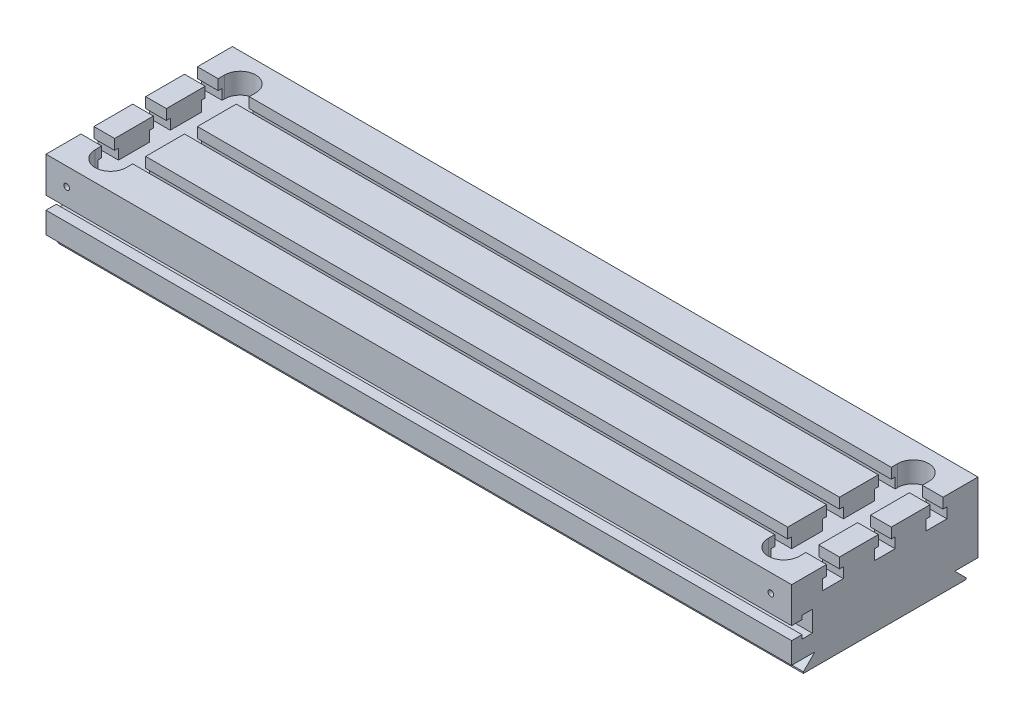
ISO-10303-21;
HEADER;
FILE_DESCRIPTION(('STEP AP214'),'2;1');
FILE_NAME('part.step','',(''),(''),'','','');
FILE_SCHEMA(('AUTOMOTIVE_DESIGN { 1 0 10303 214 1 1 1 1 }'));
ENDSEC;
DATA;
#1=APPLICATION_CONTEXT('core data for automotive mechanical design processes');
#2=APPLICATION_PROTOCOL_DEFINITION('international standard','automotive_design',2000,#1);
#3=PRODUCT_CONTEXT('',#1,'mechanical');
#4=PRODUCT('Part','Part','',(#3));
#5=PRODUCT_RELATED_PRODUCT_CATEGORY('part','',(#4));
#6=PRODUCT_DEFINITION_FORMATION('','',#4);
#7=PRODUCT_DEFINITION_CONTEXT('part definition',#1,'design');
#8=PRODUCT_DEFINITION('design','',#6,#7);
#9=PRODUCT_DEFINITION_SHAPE('','',#8);
#10=(LENGTH_UNIT() NAMED_UNIT(*) SI_UNIT(.MILLI.,.METRE.));
#11=(NAMED_UNIT(*) PLANE_ANGLE_UNIT() SI_UNIT($,.RADIAN.));
#12=(NAMED_UNIT(*) SI_UNIT($,.STERADIAN.) SOLID_ANGLE_UNIT());
#13=UNCERTAINTY_MEASURE_WITH_UNIT(LENGTH_MEASURE(1.E-05),#10,'distance_accuracy_value','');
#14=(GEOMETRIC_REPRESENTATION_CONTEXT(3) GLOBAL_UNCERTAINTY_ASSIGNED_CONTEXT((#13)) GLOBAL_UNIT_ASSIGNED_CONTEXT((#10,
#11,#12)) REPRESENTATION_CONTEXT('',''));
#15=CARTESIAN_POINT('',(0.,0.,0.));
#16=DIRECTION('',(0.,0.,1.));
#17=DIRECTION('',(1.,0.,0.));
#18=AXIS2_PLACEMENT_3D('',#15,#16,#17);
#19=CARTESIAN_POINT('',(-457.2,0.,114.3));
#20=DIRECTION('',(0.,1.,0.));
#21=DIRECTION('',(0.,0.,1.));
#22=AXIS2_PLACEMENT_3D('',#19,#20,#21);
#23=PLANE('',#22);
#24=CARTESIAN_POINT('',(412.75,0.,-79.375));
#25=DIRECTION('',(0.,-1.,0.));
#26=DIRECTION('',(0.,0.,-1.));
#27=AXIS2_PLACEMENT_3D('',#24,#25,#26);
#28=CIRCLE('',#27,19.05);
#29=CARTESIAN_POINT('',(393.7,0.,-79.375));
#30=VERTEX_POINT('',#29);
#31=CARTESIAN_POINT('',(431.8,0.,-79.375));
#32=VERTEX_POINT('',#31);
#33=EDGE_CURVE('E702',#30,#32,#28,.T.);
#34=ORIENTED_EDGE('',*,*,#33,.T.);
#35=DIRECTION('',(0.,0.,1.));
#36=VECTOR('',#35,1.);
#37=CARTESIAN_POINT('',(431.8,0.,-79.375));
#38=LINE('',#37,#36);
#39=CARTESIAN_POINT('',(431.8,0.,-71.4375));
#40=VERTEX_POINT('',#39);
#41=EDGE_CURVE('E686',#32,#40,#38,.T.);
#42=ORIENTED_EDGE('',*,*,#41,.T.);
#43=DIRECTION('',(1.,0.,0.));
#44=VECTOR('',#43,1.);
#45=CARTESIAN_POINT('',(-457.2,0.,-71.4375));
#46=LINE('',#45,#44);
#47=CARTESIAN_POINT('',(457.2,0.,-71.4375));
#48=VERTEX_POINT('',#47);
#49=EDGE_CURVE('E1454',#40,#48,#46,.T.);
#50=ORIENTED_EDGE('',*,*,#49,.T.);
#51=DIRECTION('',(0.,0.,-1.));
#52=VECTOR('',#51,1.);
#53=CARTESIAN_POINT('',(457.2,0.,-114.3));
#54=LINE('',#53,#52);
#55=CARTESIAN_POINT('',(457.2,0.,-114.3));
#56=VERTEX_POINT('',#55);
#57=EDGE_CURVE('E1185',#48,#56,#54,.T.);
#58=ORIENTED_EDGE('',*,*,#57,.T.);
#59=DIRECTION('',(-1.,0.,0.));
#60=VECTOR('',#59,1.);
#61=CARTESIAN_POINT('',(-457.2,0.,-114.3));
#62=LINE('',#61,#60);
#63=CARTESIAN_POINT('',(-457.2,0.,-114.3));
#64=VERTEX_POINT('',#63);
#65=EDGE_CURVE('E1189',#56,#64,#62,.T.);
#66=ORIENTED_EDGE('',*,*,#65,.T.);
#67=DIRECTION('',(0.,0.,1.));
#68=VECTOR('',#67,1.);
#69=CARTESIAN_POINT('',(-457.2,0.,-114.3));
#70=LINE('',#69,#68);
#71=CARTESIAN_POINT('',(-457.2,0.,-71.4375));
#72=VERTEX_POINT('',#71);
#73=EDGE_CURVE('E1177',#64,#72,#70,.T.);
#74=ORIENTED_EDGE('',*,*,#73,.T.);
#75=CARTESIAN_POINT('',(-431.8,0.,-71.4375));
#76=VERTEX_POINT('',#75);
#77=EDGE_CURVE('E1016',#72,#76,#46,.T.);
#78=ORIENTED_EDGE('',*,*,#77,.T.);
#79=DIRECTION('',(0.,0.,1.));
#80=VECTOR('',#79,1.);
#81=CARTESIAN_POINT('',(-431.8,0.,-79.375));
#82=LINE('',#81,#80);
#83=CARTESIAN_POINT('',(-431.8,0.,-79.375));
#84=VERTEX_POINT('',#83);
#85=EDGE_CURVE('E799',#84,#76,#82,.T.);
#86=ORIENTED_EDGE('',*,*,#85,.F.);
#87=CARTESIAN_POINT('',(-412.75,0.,-79.375));
#88=DIRECTION('',(0.,1.,0.));
#89=DIRECTION('',(0.,0.,-1.));
#90=AXIS2_PLACEMENT_3D('',#87,#88,#89);
#91=CIRCLE('',#90,19.05);
#92=CARTESIAN_POINT('',(-393.7,0.,-79.375));
#93=VERTEX_POINT('',#92);
#94=EDGE_CURVE('E790',#93,#84,#91,.T.);
#95=ORIENTED_EDGE('',*,*,#94,.F.);
#96=DIRECTION('',(0.,0.,-1.));
#97=VECTOR('',#96,1.);
#98=CARTESIAN_POINT('',(-393.7,0.,-79.375));
#99=LINE('',#98,#97);
#100=CARTESIAN_POINT('',(-393.7,0.,-71.4375));
#101=VERTEX_POINT('',#100);
#102=EDGE_CURVE('E795',#101,#93,#99,.T.);
#103=ORIENTED_EDGE('',*,*,#102,.F.);
#104=CARTESIAN_POINT('',(393.7,0.,-71.4375));
#105=VERTEX_POINT('',#104);
#106=EDGE_CURVE('E1441',#101,#105,#46,.T.);
#107=ORIENTED_EDGE('',*,*,#106,.T.);
#108=DIRECTION('',(0.,0.,-1.));
#109=VECTOR('',#108,1.);
#110=CARTESIAN_POINT('',(393.7,0.,-79.375));
#111=LINE('',#110,#109);
#112=EDGE_CURVE('E701',#105,#30,#111,.T.);
#113=ORIENTED_EDGE('',*,*,#112,.T.);
#114=EDGE_LOOP('',(#34,#42,#50,#58,#66,#74,#78,#86,#95,#103,#107,#113));
#115=FACE_BOUND('',#114,.T.);
#116=ADVANCED_FACE('F38',(#115),#23,.T.);
#117=DIRECTION('',(1.,0.,0.));
#118=VECTOR('',#117,1.);
#119=CARTESIAN_POINT('',(-457.2,0.,7.93749999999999));
#120=LINE('',#119,#118);
#121=CARTESIAN_POINT('',(431.8,0.,7.93749999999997));
#122=VERTEX_POINT('',#121);
#123=CARTESIAN_POINT('',(457.2,0.,7.93749999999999));
#124=VERTEX_POINT('',#123);
#125=EDGE_CURVE('E1137',#122,#124,#120,.T.);
#126=ORIENTED_EDGE('',*,*,#125,.F.);
#127=CARTESIAN_POINT('',(431.8,0.,55.5624999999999));
#128=VERTEX_POINT('',#127);
#129=EDGE_CURVE('E2640',#122,#128,#38,.T.);
#130=ORIENTED_EDGE('',*,*,#129,.T.);
#131=DIRECTION('',(1.,0.,0.));
#132=VECTOR('',#131,1.);
#133=CARTESIAN_POINT('',(-457.2,0.,55.5625));
#134=LINE('',#133,#132);
#135=CARTESIAN_POINT('',(457.2,0.,55.5625));
#136=VERTEX_POINT('',#135);
#137=EDGE_CURVE('E1061',#128,#136,#134,.T.);
#138=ORIENTED_EDGE('',*,*,#137,.T.);
#139=EDGE_CURVE('E1190',#136,#124,#54,.T.);
#140=ORIENTED_EDGE('',*,*,#139,.T.);
#141=EDGE_LOOP('',(#126,#130,#138,#140));
#142=FACE_BOUND('',#141,.T.);
#143=ADVANCED_FACE('F1294',(#142),#23,.T.);
#144=CARTESIAN_POINT('',(-393.7,0.,55.5624999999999));
#145=VERTEX_POINT('',#144);
#146=CARTESIAN_POINT('',(393.7,0.,55.5624999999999));
#147=VERTEX_POINT('',#146);
#148=EDGE_CURVE('E1060',#145,#147,#134,.T.);
#149=ORIENTED_EDGE('',*,*,#148,.T.);
#150=CARTESIAN_POINT('',(393.7,0.,7.93749999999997));
#151=VERTEX_POINT('',#150);
#152=EDGE_CURVE('E700',#147,#151,#111,.T.);
#153=ORIENTED_EDGE('',*,*,#152,.T.);
#154=CARTESIAN_POINT('',(-393.7,0.,7.93749999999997));
#155=VERTEX_POINT('',#154);
#156=EDGE_CURVE('E1176',#155,#151,#120,.T.);
#157=ORIENTED_EDGE('',*,*,#156,.F.);
#158=EDGE_CURVE('E794',#145,#155,#99,.T.);
#159=ORIENTED_EDGE('',*,*,#158,.F.);
#160=EDGE_LOOP('',(#149,#153,#157,#159));
#161=FACE_BOUND('',#160,.T.);
#162=ADVANCED_FACE('F1315',(#161),#23,.T.);
#163=DIRECTION('',(1.,0.,0.));
#164=VECTOR('',#163,1.);
#165=CARTESIAN_POINT('',(-457.2,0.,-55.5625));
#166=LINE('',#165,#164);
#167=CARTESIAN_POINT('',(431.8,0.,-55.5625));
#168=VERTEX_POINT('',#167);
#169=CARTESIAN_POINT('',(457.2,0.,-55.5625));
#170=VERTEX_POINT('',#169);
#171=EDGE_CURVE('E1003',#168,#170,#166,.T.);
#172=ORIENTED_EDGE('',*,*,#171,.F.);
#173=CARTESIAN_POINT('',(431.8,0.,-7.93750000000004));
#174=VERTEX_POINT('',#173);
#175=EDGE_CURVE('E690',#168,#174,#38,.T.);
#176=ORIENTED_EDGE('',*,*,#175,.T.);
#177=DIRECTION('',(1.,0.,0.));
#178=VECTOR('',#177,1.);
#179=CARTESIAN_POINT('',(-457.2,0.,-7.93750000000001));
#180=LINE('',#179,#178);
#181=CARTESIAN_POINT('',(457.2,0.,-7.93750000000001));
#182=VERTEX_POINT('',#181);
#183=EDGE_CURVE('E1142',#174,#182,#180,.T.);
#184=ORIENTED_EDGE('',*,*,#183,.T.);
#185=EDGE_CURVE('E1191',#182,#170,#54,.T.);
#186=ORIENTED_EDGE('',*,*,#185,.T.);
#187=EDGE_LOOP('',(#172,#176,#184,#186));
#188=FACE_BOUND('',#187,.T.);
#189=ADVANCED_FACE('F2106',(#188),#23,.T.);
#190=CARTESIAN_POINT('',(-393.7,0.,-7.93750000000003));
#191=VERTEX_POINT('',#190);
#192=CARTESIAN_POINT('',(393.7,0.,-7.93750000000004));
#193=VERTEX_POINT('',#192);
#194=EDGE_CURVE('E1000',#191,#193,#180,.T.);
#195=ORIENTED_EDGE('',*,*,#194,.T.);
#196=CARTESIAN_POINT('',(393.7,0.,-55.5625));
#197=VERTEX_POINT('',#196);
#198=EDGE_CURVE('E986',#193,#197,#111,.T.);
#199=ORIENTED_EDGE('',*,*,#198,.T.);
#200=CARTESIAN_POINT('',(-393.7,0.,-55.5625));
#201=VERTEX_POINT('',#200);
#202=EDGE_CURVE('E998',#201,#197,#166,.T.);
#203=ORIENTED_EDGE('',*,*,#202,.F.);
#204=EDGE_CURVE('E2643',#191,#201,#99,.T.);
#205=ORIENTED_EDGE('',*,*,#204,.F.);
#206=EDGE_LOOP('',(#195,#199,#203,#205));
#207=FACE_BOUND('',#206,.T.);
#208=ADVANCED_FACE('F996',(#207),#23,.T.);
#209=DIRECTION('',(1.,0.,0.));
#210=VECTOR('',#209,1.);
#211=CARTESIAN_POINT('',(-457.2,0.,71.4375));
#212=LINE('',#211,#210);
#213=CARTESIAN_POINT('',(431.8,0.,71.4375));
#214=VERTEX_POINT('',#213);
#215=CARTESIAN_POINT('',(457.2,0.,71.4375));
#216=VERTEX_POINT('',#215);
#217=EDGE_CURVE('E1055',#214,#216,#212,.T.);
#218=ORIENTED_EDGE('',*,*,#217,.F.);
#219=CARTESIAN_POINT('',(431.8,0.,79.375));
#220=VERTEX_POINT('',#219);
#221=EDGE_CURVE('E691',#214,#220,#38,.T.);
#222=ORIENTED_EDGE('',*,*,#221,.T.);
#223=CARTESIAN_POINT('',(412.75,0.,79.375));
#224=DIRECTION('',(0.,-1.,0.));
#225=DIRECTION('',(0.,0.,1.));
#226=AXIS2_PLACEMENT_3D('',#223,#224,#225);
#227=CIRCLE('',#226,19.05);
#228=CARTESIAN_POINT('',(393.7,0.,79.375));
#229=VERTEX_POINT('',#228);
#230=EDGE_CURVE('E692',#220,#229,#227,.T.);
#231=ORIENTED_EDGE('',*,*,#230,.T.);
#232=CARTESIAN_POINT('',(393.7,0.,71.4375));
#233=VERTEX_POINT('',#232);
#234=EDGE_CURVE('E696',#229,#233,#111,.T.);
#235=ORIENTED_EDGE('',*,*,#234,.T.);
#236=CARTESIAN_POINT('',(-393.7,0.,71.4375));
#237=VERTEX_POINT('',#236);
#238=EDGE_CURVE('E1095',#237,#233,#212,.T.);
#239=ORIENTED_EDGE('',*,*,#238,.F.);
#240=CARTESIAN_POINT('',(-393.7,0.,79.375));
#241=VERTEX_POINT('',#240);
#242=EDGE_CURVE('E791',#241,#237,#99,.T.);
#243=ORIENTED_EDGE('',*,*,#242,.F.);
#244=CARTESIAN_POINT('',(-412.75,0.,79.375));
#245=DIRECTION('',(0.,1.,0.));
#246=DIRECTION('',(0.,0.,1.));
#247=AXIS2_PLACEMENT_3D('',#244,#245,#246);
#248=CIRCLE('',#247,19.05);
#249=CARTESIAN_POINT('',(-431.8,0.,79.375));
#250=VERTEX_POINT('',#249);
#251=EDGE_CURVE('E796',#250,#241,#248,.T.);
#252=ORIENTED_EDGE('',*,*,#251,.F.);
#253=CARTESIAN_POINT('',(-431.8,0.,71.4375));
#254=VERTEX_POINT('',#253);
#255=EDGE_CURVE('E802',#254,#250,#82,.T.);
#256=ORIENTED_EDGE('',*,*,#255,.F.);
#257=CARTESIAN_POINT('',(-457.2,0.,71.4375));
#258=VERTEX_POINT('',#257);
#259=EDGE_CURVE('E1092',#258,#254,#212,.T.);
#260=ORIENTED_EDGE('',*,*,#259,.F.);
#261=CARTESIAN_POINT('',(-457.2,0.,114.3));
#262=VERTEX_POINT('',#261);
#263=EDGE_CURVE('E1141',#258,#262,#70,.T.);
#264=ORIENTED_EDGE('',*,*,#263,.T.);
#265=DIRECTION('',(1.,0.,0.));
#266=VECTOR('',#265,1.);
#267=CARTESIAN_POINT('',(-457.2,0.,114.3));
#268=LINE('',#267,#266);
#269=CARTESIAN_POINT('',(457.2,0.,114.3));
#270=VERTEX_POINT('',#269);
#271=EDGE_CURVE('E1180',#262,#270,#268,.T.);
#272=ORIENTED_EDGE('',*,*,#271,.T.);
#273=EDGE_CURVE('E1186',#270,#216,#54,.T.);
#274=ORIENTED_EDGE('',*,*,#273,.T.);
#275=EDGE_LOOP('',(#218,#222,#231,#235,#239,#243,#252,#256,#260,#264,#272,#274));
#276=FACE_BOUND('',#275,.T.);
#277=ADVANCED_FACE('F1373',(#276),#23,.T.);
#278=CARTESIAN_POINT('',(-457.2,-12.7,-7.9375));
#279=DIRECTION('',(0.,0.,-1.));
#280=DIRECTION('',(0.,1.,0.));
#281=AXIS2_PLACEMENT_3D('',#278,#279,#280);
#282=PLANE('',#281);
#283=DIRECTION('',(0.,1.,0.));
#284=VECTOR('',#283,1.);
#285=CARTESIAN_POINT('',(431.8,-12.7,-7.9375));
#286=LINE('',#285,#284);
#287=CARTESIAN_POINT('',(431.8,-12.7,-7.9375));
#288=VERTEX_POINT('',#287);
#289=EDGE_CURVE('E788',#288,#174,#286,.T.);
#290=ORIENTED_EDGE('',*,*,#289,.F.);
#291=DIRECTION('',(1.,0.,0.));
#292=VECTOR('',#291,1.);
#293=CARTESIAN_POINT('',(-457.2,-12.7,-7.9375));
#294=LINE('',#293,#292);
#295=CARTESIAN_POINT('',(457.2,-12.7,-7.9375));
#296=VERTEX_POINT('',#295);
#297=EDGE_CURVE('E1147',#288,#296,#294,.T.);
#298=ORIENTED_EDGE('',*,*,#297,.T.);
#299=DIRECTION('',(0.,1.,0.));
#300=VECTOR('',#299,1.);
#301=CARTESIAN_POINT('',(457.2,-12.7,-7.9375));
#302=LINE('',#301,#300);
#303=EDGE_CURVE('E1113',#296,#182,#302,.T.);
#304=ORIENTED_EDGE('',*,*,#303,.T.);
#305=ORIENTED_EDGE('',*,*,#183,.F.);
#306=EDGE_LOOP('',(#290,#298,#304,#305));
#307=FACE_BOUND('',#306,.T.);
#308=ADVANCED_FACE('F1587',(#307),#282,.F.);
#309=DIRECTION('',(0.,-1.,0.));
#310=VECTOR('',#309,1.);
#311=CARTESIAN_POINT('',(393.7,-12.7,-7.9375));
#312=LINE('',#311,#310);
#313=CARTESIAN_POINT('',(393.7,-12.7,-7.9375));
#314=VERTEX_POINT('',#313);
#315=EDGE_CURVE('E754',#193,#314,#312,.T.);
#316=ORIENTED_EDGE('',*,*,#315,.F.);
#317=ORIENTED_EDGE('',*,*,#194,.F.);
#318=DIRECTION('',(0.,-1.,0.));
#319=VECTOR('',#318,1.);
#320=CARTESIAN_POINT('',(-393.7,-12.7,-7.9375));
#321=LINE('',#320,#319);
#322=CARTESIAN_POINT('',(-393.7,-12.7,-7.9375));
#323=VERTEX_POINT('',#322);
#324=EDGE_CURVE('E878',#191,#323,#321,.T.);
#325=ORIENTED_EDGE('',*,*,#324,.T.);
#326=EDGE_CURVE('E1146',#323,#314,#294,.T.);
#327=ORIENTED_EDGE('',*,*,#326,.T.);
#328=EDGE_LOOP('',(#316,#317,#325,#327));
#329=FACE_BOUND('',#328,.T.);
#330=ADVANCED_FACE('F1588',(#329),#282,.F.);
#331=CARTESIAN_POINT('',(-457.2,-12.7,-12.7));
#332=DIRECTION('',(0.,1.,0.));
#333=DIRECTION('',(0.,0.,1.));
#334=AXIS2_PLACEMENT_3D('',#331,#332,#333);
#335=PLANE('',#334);
#336=DIRECTION('',(0.,0.,1.));
#337=VECTOR('',#336,1.);
#338=CARTESIAN_POINT('',(431.8,-12.7,-12.7));
#339=LINE('',#338,#337);
#340=CARTESIAN_POINT('',(431.8,-12.7,-12.7));
#341=VERTEX_POINT('',#340);
#342=EDGE_CURVE('E786',#341,#288,#339,.T.);
#343=ORIENTED_EDGE('',*,*,#342,.F.);
#344=DIRECTION('',(1.,0.,0.));
#345=VECTOR('',#344,1.);
#346=CARTESIAN_POINT('',(-457.2,-12.7,-12.7));
#347=LINE('',#346,#345);
#348=CARTESIAN_POINT('',(457.2,-12.7,-12.7));
#349=VERTEX_POINT('',#348);
#350=EDGE_CURVE('E1152',#341,#349,#347,.T.);
#351=ORIENTED_EDGE('',*,*,#350,.T.);
#352=DIRECTION('',(0.,0.,1.));
#353=VECTOR('',#352,1.);
#354=CARTESIAN_POINT('',(457.2,-12.7,-12.7));
#355=LINE('',#354,#353);
#356=EDGE_CURVE('E1110',#349,#296,#355,.T.);
#357=ORIENTED_EDGE('',*,*,#356,.T.);
#358=ORIENTED_EDGE('',*,*,#297,.F.);
#359=EDGE_LOOP('',(#343,#351,#357,#358));
#360=FACE_BOUND('',#359,.T.);
#361=ADVANCED_FACE('F2144',(#360),#335,.F.);
#362=DIRECTION('',(0.,0.,-1.));
#363=VECTOR('',#362,1.);
#364=CARTESIAN_POINT('',(393.7,-12.7,-12.7));
#365=LINE('',#364,#363);
#366=CARTESIAN_POINT('',(393.7,-12.7,-12.7));
#367=VERTEX_POINT('',#366);
#368=EDGE_CURVE('E752',#314,#367,#365,.T.);
#369=ORIENTED_EDGE('',*,*,#368,.F.);
#370=ORIENTED_EDGE('',*,*,#326,.F.);
#371=DIRECTION('',(0.,0.,-1.));
#372=VECTOR('',#371,1.);
#373=CARTESIAN_POINT('',(-393.7,-12.7,-12.7));
#374=LINE('',#373,#372);
#375=CARTESIAN_POINT('',(-393.7,-12.7,-12.7));
#376=VERTEX_POINT('',#375);
#377=EDGE_CURVE('E875',#323,#376,#374,.T.);
#378=ORIENTED_EDGE('',*,*,#377,.T.);
#379=EDGE_CURVE('E1151',#376,#367,#347,.T.);
#380=ORIENTED_EDGE('',*,*,#379,.T.);
#381=EDGE_LOOP('',(#369,#370,#378,#380));
#382=FACE_BOUND('',#381,.T.);
#383=ADVANCED_FACE('F2153',(#382),#335,.F.);
#384=CARTESIAN_POINT('',(-457.2,-25.4,-12.7));
#385=DIRECTION('',(0.,0.,-1.));
#386=DIRECTION('',(0.,1.,0.));
#387=AXIS2_PLACEMENT_3D('',#384,#385,#386);
#388=PLANE('',#387);
#389=DIRECTION('',(0.,1.,0.));
#390=VECTOR('',#389,1.);
#391=CARTESIAN_POINT('',(431.8,-25.4,-12.7));
#392=LINE('',#391,#390);
#393=CARTESIAN_POINT('',(431.8,-25.4,-12.7));
#394=VERTEX_POINT('',#393);
#395=EDGE_CURVE('E784',#394,#341,#392,.T.);
#396=ORIENTED_EDGE('',*,*,#395,.F.);
#397=DIRECTION('',(1.,0.,0.));
#398=VECTOR('',#397,1.);
#399=CARTESIAN_POINT('',(-457.2,-25.4,-12.7));
#400=LINE('',#399,#398);
#401=CARTESIAN_POINT('',(457.2,-25.4,-12.7));
#402=VERTEX_POINT('',#401);
#403=EDGE_CURVE('E1157',#394,#402,#400,.T.);
#404=ORIENTED_EDGE('',*,*,#403,.T.);
#405=DIRECTION('',(0.,1.,0.));
#406=VECTOR('',#405,1.);
#407=CARTESIAN_POINT('',(457.2,-25.4,-12.7));
#408=LINE('',#407,#406);
#409=EDGE_CURVE('E1107',#402,#349,#408,.T.);
#410=ORIENTED_EDGE('',*,*,#409,.T.);
#411=ORIENTED_EDGE('',*,*,#350,.F.);
#412=EDGE_LOOP('',(#396,#404,#410,#411));
#413=FACE_BOUND('',#412,.T.);
#414=ADVANCED_FACE('F1398',(#413),#388,.F.);
#415=DIRECTION('',(0.,-1.,0.));
#416=VECTOR('',#415,1.);
#417=CARTESIAN_POINT('',(393.7,-25.4,-12.7));
#418=LINE('',#417,#416);
#419=CARTESIAN_POINT('',(393.7,-25.4,-12.7));
#420=VERTEX_POINT('',#419);
#421=EDGE_CURVE('E750',#367,#420,#418,.T.);
#422=ORIENTED_EDGE('',*,*,#421,.F.);
#423=ORIENTED_EDGE('',*,*,#379,.F.);
#424=DIRECTION('',(0.,-1.,0.));
#425=VECTOR('',#424,1.);
#426=CARTESIAN_POINT('',(-393.7,-25.4,-12.7));
#427=LINE('',#426,#425);
#428=CARTESIAN_POINT('',(-393.7,-25.4,-12.7));
#429=VERTEX_POINT('',#428);
#430=EDGE_CURVE('E872',#376,#429,#427,.T.);
#431=ORIENTED_EDGE('',*,*,#430,.T.);
#432=EDGE_CURVE('E1156',#429,#420,#400,.T.);
#433=ORIENTED_EDGE('',*,*,#432,.T.);
#434=EDGE_LOOP('',(#422,#423,#431,#433));
#435=FACE_BOUND('',#434,.T.);
#436=ADVANCED_FACE('F1405',(#435),#388,.F.);
#437=CARTESIAN_POINT('',(-457.2,-12.7,12.7));
#438=DIRECTION('',(0.,0.,1.));
#439=DIRECTION('',(0.,-1.,0.));
#440=AXIS2_PLACEMENT_3D('',#437,#438,#439);
#441=PLANE('',#440);
#442=DIRECTION('',(0.,-1.,0.));
#443=VECTOR('',#442,1.);
#444=CARTESIAN_POINT('',(431.8,-12.7,12.7));
#445=LINE('',#444,#443);
#446=CARTESIAN_POINT('',(431.8,-12.7,12.7));
#447=VERTEX_POINT('',#446);
#448=CARTESIAN_POINT('',(431.8,-25.4,12.7));
#449=VERTEX_POINT('',#448);
#450=EDGE_CURVE('E782',#447,#449,#445,.T.);
#451=ORIENTED_EDGE('',*,*,#450,.F.);
#452=DIRECTION('',(1.,0.,0.));
#453=VECTOR('',#452,1.);
#454=CARTESIAN_POINT('',(-457.2,-12.7,12.7));
#455=LINE('',#454,#453);
#456=CARTESIAN_POINT('',(457.2,-12.7,12.7));
#457=VERTEX_POINT('',#456);
#458=EDGE_CURVE('E1167',#447,#457,#455,.T.);
#459=ORIENTED_EDGE('',*,*,#458,.T.);
#460=DIRECTION('',(0.,-1.,0.));
#461=VECTOR('',#460,1.);
#462=CARTESIAN_POINT('',(457.2,-12.7,12.7));
#463=LINE('',#462,#461);
#464=CARTESIAN_POINT('',(457.2,-25.4,12.7));
#465=VERTEX_POINT('',#464);
#466=EDGE_CURVE('E1101',#457,#465,#463,.T.);
#467=ORIENTED_EDGE('',*,*,#466,.T.);
#468=DIRECTION('',(1.,0.,0.));
#469=VECTOR('',#468,1.);
#470=CARTESIAN_POINT('',(-457.2,-25.4,12.7));
#471=LINE('',#470,#469);
#472=EDGE_CURVE('E1162',#449,#465,#471,.T.);
#473=ORIENTED_EDGE('',*,*,#472,.F.);
#474=EDGE_LOOP('',(#451,#459,#467,#473));
#475=FACE_BOUND('',#474,.T.);
#476=ADVANCED_FACE('F2180',(#475),#441,.F.);
#477=DIRECTION('',(0.,1.,0.));
#478=VECTOR('',#477,1.);
#479=CARTESIAN_POINT('',(393.7,-12.7,12.7));
#480=LINE('',#479,#478);
#481=CARTESIAN_POINT('',(393.7,-25.4,12.7));
#482=VERTEX_POINT('',#481);
#483=CARTESIAN_POINT('',(393.7,-12.7,12.7));
#484=VERTEX_POINT('',#483);
#485=EDGE_CURVE('E748',#482,#484,#480,.T.);
#486=ORIENTED_EDGE('',*,*,#485,.F.);
#487=CARTESIAN_POINT('',(-393.7,-25.4,12.7));
#488=VERTEX_POINT('',#487);
#489=EDGE_CURVE('E1161',#488,#482,#471,.T.);
#490=ORIENTED_EDGE('',*,*,#489,.F.);
#491=DIRECTION('',(0.,1.,0.));
#492=VECTOR('',#491,1.);
#493=CARTESIAN_POINT('',(-393.7,-12.7,12.7));
#494=LINE('',#493,#492);
#495=CARTESIAN_POINT('',(-393.7,-12.7,12.7));
#496=VERTEX_POINT('',#495);
#497=EDGE_CURVE('E869',#488,#496,#494,.T.);
#498=ORIENTED_EDGE('',*,*,#497,.T.);
#499=EDGE_CURVE('E1166',#496,#484,#455,.T.);
#500=ORIENTED_EDGE('',*,*,#499,.T.);
#501=EDGE_LOOP('',(#486,#490,#498,#500));
#502=FACE_BOUND('',#501,.T.);
#503=ADVANCED_FACE('F2188',(#502),#441,.F.);
#504=CARTESIAN_POINT('',(-457.2,-12.7,7.9375));
#505=DIRECTION('',(0.,1.,0.));
#506=DIRECTION('',(0.,0.,1.));
#507=AXIS2_PLACEMENT_3D('',#504,#505,#506);
#508=PLANE('',#507);
#509=DIRECTION('',(0.,0.,1.));
#510=VECTOR('',#509,1.);
#511=CARTESIAN_POINT('',(431.8,-12.7,7.9375));
#512=LINE('',#511,#510);
#513=CARTESIAN_POINT('',(431.8,-12.7,7.9375));
#514=VERTEX_POINT('',#513);
#515=EDGE_CURVE('E780',#514,#447,#512,.T.);
#516=ORIENTED_EDGE('',*,*,#515,.F.);
#517=DIRECTION('',(1.,0.,0.));
#518=VECTOR('',#517,1.);
#519=CARTESIAN_POINT('',(-457.2,-12.7,7.9375));
#520=LINE('',#519,#518);
#521=CARTESIAN_POINT('',(457.2,-12.7,7.9375));
#522=VERTEX_POINT('',#521);
#523=EDGE_CURVE('E1172',#514,#522,#520,.T.);
#524=ORIENTED_EDGE('',*,*,#523,.T.);
#525=DIRECTION('',(0.,0.,1.));
#526=VECTOR('',#525,1.);
#527=CARTESIAN_POINT('',(457.2,-12.7,7.9375));
#528=LINE('',#527,#526);
#529=EDGE_CURVE('E1098',#522,#457,#528,.T.);
#530=ORIENTED_EDGE('',*,*,#529,.T.);
#531=ORIENTED_EDGE('',*,*,#458,.F.);
#532=EDGE_LOOP('',(#516,#524,#530,#531));
#533=FACE_BOUND('',#532,.T.);
#534=ADVANCED_FACE('F2199',(#533),#508,.F.);
#535=DIRECTION('',(0.,0.,-1.));
#536=VECTOR('',#535,1.);
#537=CARTESIAN_POINT('',(393.7,-12.7,7.9375));
#538=LINE('',#537,#536);
#539=CARTESIAN_POINT('',(393.7,-12.7,7.9375));
#540=VERTEX_POINT('',#539);
#541=EDGE_CURVE('E746',#484,#540,#538,.T.);
#542=ORIENTED_EDGE('',*,*,#541,.F.);
#543=ORIENTED_EDGE('',*,*,#499,.F.);
#544=DIRECTION('',(0.,0.,-1.));
#545=VECTOR('',#544,1.);
#546=CARTESIAN_POINT('',(-393.7,-12.7,7.9375));
#547=LINE('',#546,#545);
#548=CARTESIAN_POINT('',(-393.7,-12.7,7.9375));
#549=VERTEX_POINT('',#548);
#550=EDGE_CURVE('E866',#496,#549,#547,.T.);
#551=ORIENTED_EDGE('',*,*,#550,.T.);
#552=EDGE_CURVE('E1171',#549,#540,#520,.T.);
#553=ORIENTED_EDGE('',*,*,#552,.T.);
#554=EDGE_LOOP('',(#542,#543,#551,#553));
#555=FACE_BOUND('',#554,.T.);
#556=ADVANCED_FACE('F2208',(#555),#508,.F.);
#557=CARTESIAN_POINT('',(-457.2,0.,7.93749999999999));
#558=DIRECTION('',(0.,0.,1.));
#559=DIRECTION('',(0.,-1.,0.));
#560=AXIS2_PLACEMENT_3D('',#557,#558,#559);
#561=PLANE('',#560);
#562=DIRECTION('',(0.,-1.,0.));
#563=VECTOR('',#562,1.);
#564=CARTESIAN_POINT('',(431.8,0.,7.93749999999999));
#565=LINE('',#564,#563);
#566=EDGE_CURVE('E778',#122,#514,#565,.T.);
#567=ORIENTED_EDGE('',*,*,#566,.F.);
#568=ORIENTED_EDGE('',*,*,#125,.T.);
#569=DIRECTION('',(0.,-1.,0.));
#570=VECTOR('',#569,1.);
#571=CARTESIAN_POINT('',(457.2,0.,7.93749999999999));
#572=LINE('',#571,#570);
#573=EDGE_CURVE('E1059',#124,#522,#572,.T.);
#574=ORIENTED_EDGE('',*,*,#573,.T.);
#575=ORIENTED_EDGE('',*,*,#523,.F.);
#576=EDGE_LOOP('',(#567,#568,#574,#575));
#577=FACE_BOUND('',#576,.T.);
#578=ADVANCED_FACE('F1303',(#577),#561,.F.);
#579=DIRECTION('',(0.,1.,0.));
#580=VECTOR('',#579,1.);
#581=CARTESIAN_POINT('',(393.7,0.,7.93749999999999));
#582=LINE('',#581,#580);
#583=EDGE_CURVE('E744',#540,#151,#582,.T.);
#584=ORIENTED_EDGE('',*,*,#583,.F.);
#585=ORIENTED_EDGE('',*,*,#552,.F.);
#586=DIRECTION('',(0.,1.,0.));
#587=VECTOR('',#586,1.);
#588=CARTESIAN_POINT('',(-393.7,0.,7.93749999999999));
#589=LINE('',#588,#587);
#590=EDGE_CURVE('E863',#549,#155,#589,.T.);
#591=ORIENTED_EDGE('',*,*,#590,.T.);
#592=ORIENTED_EDGE('',*,*,#156,.T.);
#593=EDGE_LOOP('',(#584,#585,#591,#592));
#594=FACE_BOUND('',#593,.T.);
#595=ADVANCED_FACE('F1308',(#594),#561,.F.);
#596=CARTESIAN_POINT('',(-457.2,-12.7,55.5625));
#597=DIRECTION('',(0.,0.,-1.));
#598=DIRECTION('',(0.,1.,0.));
#599=AXIS2_PLACEMENT_3D('',#596,#597,#598);
#600=PLANE('',#599);
#601=DIRECTION('',(0.,1.,0.));
#602=VECTOR('',#601,1.);
#603=CARTESIAN_POINT('',(431.8,-12.7,55.5625));
#604=LINE('',#603,#602);
#605=CARTESIAN_POINT('',(431.8,-12.7,55.5625));
#606=VERTEX_POINT('',#605);
#607=EDGE_CURVE('E776',#606,#128,#604,.T.);
#608=ORIENTED_EDGE('',*,*,#607,.F.);
#609=DIRECTION('',(1.,0.,0.));
#610=VECTOR('',#609,1.);
#611=CARTESIAN_POINT('',(-457.2,-12.7,55.5625));
#612=LINE('',#611,#610);
#613=CARTESIAN_POINT('',(457.2,-12.7,55.5625));
#614=VERTEX_POINT('',#613);
#615=EDGE_CURVE('E1066',#606,#614,#612,.T.);
#616=ORIENTED_EDGE('',*,*,#615,.T.);
#617=DIRECTION('',(0.,1.,0.));
#618=VECTOR('',#617,1.);
#619=CARTESIAN_POINT('',(457.2,-12.7,55.5625));
#620=LINE('',#619,#618);
#621=EDGE_CURVE('E1031',#614,#136,#620,.T.);
#622=ORIENTED_EDGE('',*,*,#621,.T.);
#623=ORIENTED_EDGE('',*,*,#137,.F.);
#624=EDGE_LOOP('',(#608,#616,#622,#623));
#625=FACE_BOUND('',#624,.T.);
#626=ADVANCED_FACE('F1329',(#625),#600,.F.);
#627=DIRECTION('',(0.,-1.,0.));
#628=VECTOR('',#627,1.);
#629=CARTESIAN_POINT('',(393.7,-12.7,55.5625));
#630=LINE('',#629,#628);
#631=CARTESIAN_POINT('',(393.7,-12.7,55.5625));
#632=VERTEX_POINT('',#631);
#633=EDGE_CURVE('E742',#147,#632,#630,.T.);
#634=ORIENTED_EDGE('',*,*,#633,.F.);
#635=ORIENTED_EDGE('',*,*,#148,.F.);
#636=DIRECTION('',(0.,-1.,0.));
#637=VECTOR('',#636,1.);
#638=CARTESIAN_POINT('',(-393.7,-12.7,55.5625));
#639=LINE('',#638,#637);
#640=CARTESIAN_POINT('',(-393.7,-12.7,55.5625));
#641=VERTEX_POINT('',#640);
#642=EDGE_CURVE('E860',#145,#641,#639,.T.);
#643=ORIENTED_EDGE('',*,*,#642,.T.);
#644=EDGE_CURVE('E1065',#641,#632,#612,.T.);
#645=ORIENTED_EDGE('',*,*,#644,.T.);
#646=EDGE_LOOP('',(#634,#635,#643,#645));
#647=FACE_BOUND('',#646,.T.);
#648=ADVANCED_FACE('F1323',(#647),#600,.F.);
#649=CARTESIAN_POINT('',(-457.2,-12.7,50.8));
#650=DIRECTION('',(0.,1.,0.));
#651=DIRECTION('',(0.,0.,1.));
#652=AXIS2_PLACEMENT_3D('',#649,#650,#651);
#653=PLANE('',#652);
#654=DIRECTION('',(0.,0.,1.));
#655=VECTOR('',#654,1.);
#656=CARTESIAN_POINT('',(431.8,-12.7,50.8));
#657=LINE('',#656,#655);
#658=CARTESIAN_POINT('',(431.8,-12.7,50.8));
#659=VERTEX_POINT('',#658);
#660=EDGE_CURVE('E774',#659,#606,#657,.T.);
#661=ORIENTED_EDGE('',*,*,#660,.F.);
#662=DIRECTION('',(1.,0.,0.));
#663=VECTOR('',#662,1.);
#664=CARTESIAN_POINT('',(-457.2,-12.7,50.8));
#665=LINE('',#664,#663);
#666=CARTESIAN_POINT('',(457.2,-12.7,50.8));
#667=VERTEX_POINT('',#666);
#668=EDGE_CURVE('E1071',#659,#667,#665,.T.);
#669=ORIENTED_EDGE('',*,*,#668,.T.);
#670=DIRECTION('',(0.,0.,1.));
#671=VECTOR('',#670,1.);
#672=CARTESIAN_POINT('',(457.2,-12.7,50.8));
#673=LINE('',#672,#671);
#674=EDGE_CURVE('E1028',#667,#614,#673,.T.);
#675=ORIENTED_EDGE('',*,*,#674,.T.);
#676=ORIENTED_EDGE('',*,*,#615,.F.);
#677=EDGE_LOOP('',(#661,#669,#675,#676));
#678=FACE_BOUND('',#677,.T.);
#679=ADVANCED_FACE('F1333',(#678),#653,.F.);
#680=DIRECTION('',(0.,0.,-1.));
#681=VECTOR('',#680,1.);
#682=CARTESIAN_POINT('',(393.7,-12.7,50.8));
#683=LINE('',#682,#681);
#684=CARTESIAN_POINT('',(393.7,-12.7,50.8));
#685=VERTEX_POINT('',#684);
#686=EDGE_CURVE('E740',#632,#685,#683,.T.);
#687=ORIENTED_EDGE('',*,*,#686,.F.);
#688=ORIENTED_EDGE('',*,*,#644,.F.);
#689=DIRECTION('',(0.,0.,-1.));
#690=VECTOR('',#689,1.);
#691=CARTESIAN_POINT('',(-393.7,-12.7,50.8));
#692=LINE('',#691,#690);
#693=CARTESIAN_POINT('',(-393.7,-12.7,50.8));
#694=VERTEX_POINT('',#693);
#695=EDGE_CURVE('E857',#641,#694,#692,.T.);
#696=ORIENTED_EDGE('',*,*,#695,.T.);
#697=EDGE_CURVE('E1070',#694,#685,#665,.T.);
#698=ORIENTED_EDGE('',*,*,#697,.T.);
#699=EDGE_LOOP('',(#687,#688,#696,#698));
#700=FACE_BOUND('',#699,.T.);
#701=ADVANCED_FACE('F2258',(#700),#653,.F.);
#702=CARTESIAN_POINT('',(-457.2,-25.4,50.8));
#703=DIRECTION('',(0.,0.,-1.));
#704=DIRECTION('',(0.,1.,0.));
#705=AXIS2_PLACEMENT_3D('',#702,#703,#704);
#706=PLANE('',#705);
#707=DIRECTION('',(0.,1.,0.));
#708=VECTOR('',#707,1.);
#709=CARTESIAN_POINT('',(431.8,-25.4,50.8));
#710=LINE('',#709,#708);
#711=CARTESIAN_POINT('',(431.8,-25.4,50.8));
#712=VERTEX_POINT('',#711);
#713=EDGE_CURVE('E772',#712,#659,#710,.T.);
#714=ORIENTED_EDGE('',*,*,#713,.F.);
#715=DIRECTION('',(1.,0.,0.));
#716=VECTOR('',#715,1.);
#717=CARTESIAN_POINT('',(-457.2,-25.4,50.8));
#718=LINE('',#717,#716);
#719=CARTESIAN_POINT('',(457.2,-25.4,50.8));
#720=VERTEX_POINT('',#719);
#721=EDGE_CURVE('E1076',#712,#720,#718,.T.);
#722=ORIENTED_EDGE('',*,*,#721,.T.);
#723=DIRECTION('',(0.,1.,0.));
#724=VECTOR('',#723,1.);
#725=CARTESIAN_POINT('',(457.2,-25.4,50.8));
#726=LINE('',#725,#724);
#727=EDGE_CURVE('E1025',#720,#667,#726,.T.);
#728=ORIENTED_EDGE('',*,*,#727,.T.);
#729=ORIENTED_EDGE('',*,*,#668,.F.);
#730=EDGE_LOOP('',(#714,#722,#728,#729));
#731=FACE_BOUND('',#730,.T.);
#732=ADVANCED_FACE('F1340',(#731),#706,.F.);
#733=DIRECTION('',(0.,-1.,0.));
#734=VECTOR('',#733,1.);
#735=CARTESIAN_POINT('',(393.7,-25.4,50.8));
#736=LINE('',#735,#734);
#737=CARTESIAN_POINT('',(393.7,-25.4,50.8));
#738=VERTEX_POINT('',#737);
#739=EDGE_CURVE('E738',#685,#738,#736,.T.);
#740=ORIENTED_EDGE('',*,*,#739,.F.);
#741=ORIENTED_EDGE('',*,*,#697,.F.);
#742=DIRECTION('',(0.,-1.,0.));
#743=VECTOR('',#742,1.);
#744=CARTESIAN_POINT('',(-393.7,-25.4,50.8));
#745=LINE('',#744,#743);
#746=CARTESIAN_POINT('',(-393.7,-25.4,50.8));
#747=VERTEX_POINT('',#746);
#748=EDGE_CURVE('E854',#694,#747,#745,.T.);
#749=ORIENTED_EDGE('',*,*,#748,.T.);
#750=EDGE_CURVE('E1075',#747,#738,#718,.T.);
#751=ORIENTED_EDGE('',*,*,#750,.T.);
#752=EDGE_LOOP('',(#740,#741,#749,#751));
#753=FACE_BOUND('',#752,.T.);
#754=ADVANCED_FACE('F2275',(#753),#706,.F.);
#755=CARTESIAN_POINT('',(-457.2,-12.7,76.2));
#756=DIRECTION('',(0.,0.,1.));
#757=DIRECTION('',(0.,-1.,0.));
#758=AXIS2_PLACEMENT_3D('',#755,#756,#757);
#759=PLANE('',#758);
#760=DIRECTION('',(0.,-1.,0.));
#761=VECTOR('',#760,1.);
#762=CARTESIAN_POINT('',(431.8,-12.7,76.2));
#763=LINE('',#762,#761);
#764=CARTESIAN_POINT('',(431.8,-12.7,76.2));
#765=VERTEX_POINT('',#764);
#766=CARTESIAN_POINT('',(431.8,-25.4,76.2));
#767=VERTEX_POINT('',#766);
#768=EDGE_CURVE('E770',#765,#767,#763,.T.);
#769=ORIENTED_EDGE('',*,*,#768,.F.);
#770=DIRECTION('',(1.,0.,0.));
#771=VECTOR('',#770,1.);
#772=CARTESIAN_POINT('',(-457.2,-12.7,76.2));
#773=LINE('',#772,#771);
#774=CARTESIAN_POINT('',(457.2,-12.7,76.2));
#775=VERTEX_POINT('',#774);
#776=EDGE_CURVE('E1086',#765,#775,#773,.T.);
#777=ORIENTED_EDGE('',*,*,#776,.T.);
#778=DIRECTION('',(0.,-1.,0.));
#779=VECTOR('',#778,1.);
#780=CARTESIAN_POINT('',(457.2,-12.7,76.2));
#781=LINE('',#780,#779);
#782=CARTESIAN_POINT('',(457.2,-25.4,76.2));
#783=VERTEX_POINT('',#782);
#784=EDGE_CURVE('E1019',#775,#783,#781,.T.);
#785=ORIENTED_EDGE('',*,*,#784,.T.);
#786=DIRECTION('',(1.,0.,0.));
#787=VECTOR('',#786,1.);
#788=CARTESIAN_POINT('',(-457.2,-25.4,76.2));
#789=LINE('',#788,#787);
#790=EDGE_CURVE('E1081',#767,#783,#789,.T.);
#791=ORIENTED_EDGE('',*,*,#790,.F.);
#792=EDGE_LOOP('',(#769,#777,#785,#791));
#793=FACE_BOUND('',#792,.T.);
#794=ADVANCED_FACE('F1351',(#793),#759,.F.);
#795=DIRECTION('',(0.,1.,0.));
#796=VECTOR('',#795,1.);
#797=CARTESIAN_POINT('',(393.7,-12.7,76.2));
#798=LINE('',#797,#796);
#799=CARTESIAN_POINT('',(393.7,-25.4,76.2));
#800=VERTEX_POINT('',#799);
#801=CARTESIAN_POINT('',(393.7,-12.7,76.2));
#802=VERTEX_POINT('',#801);
#803=EDGE_CURVE('E736',#800,#802,#798,.T.);
#804=ORIENTED_EDGE('',*,*,#803,.F.);
#805=CARTESIAN_POINT('',(-393.7,-25.4,76.2));
#806=VERTEX_POINT('',#805);
#807=EDGE_CURVE('E1080',#806,#800,#789,.T.);
#808=ORIENTED_EDGE('',*,*,#807,.F.);
#809=DIRECTION('',(0.,1.,0.));
#810=VECTOR('',#809,1.);
#811=CARTESIAN_POINT('',(-393.7,-12.7,76.2));
#812=LINE('',#811,#810);
#813=CARTESIAN_POINT('',(-393.7,-12.7,76.2));
#814=VERTEX_POINT('',#813);
#815=EDGE_CURVE('E851',#806,#814,#812,.T.);
#816=ORIENTED_EDGE('',*,*,#815,.T.);
#817=EDGE_CURVE('E1085',#814,#802,#773,.T.);
#818=ORIENTED_EDGE('',*,*,#817,.T.);
#819=EDGE_LOOP('',(#804,#808,#816,#818));
#820=FACE_BOUND('',#819,.T.);
#821=ADVANCED_FACE('F2293',(#820),#759,.F.);
#822=CARTESIAN_POINT('',(-457.2,-12.7,71.4375));
#823=DIRECTION('',(0.,1.,0.));
#824=DIRECTION('',(0.,0.,1.));
#825=AXIS2_PLACEMENT_3D('',#822,#823,#824);
#826=PLANE('',#825);
#827=DIRECTION('',(0.,0.,1.));
#828=VECTOR('',#827,1.);
#829=CARTESIAN_POINT('',(431.8,-12.7,71.4375));
#830=LINE('',#829,#828);
#831=CARTESIAN_POINT('',(431.8,-12.7,71.4375));
#832=VERTEX_POINT('',#831);
#833=EDGE_CURVE('E768',#832,#765,#830,.T.);
#834=ORIENTED_EDGE('',*,*,#833,.F.);
#835=DIRECTION('',(1.,0.,0.));
#836=VECTOR('',#835,1.);
#837=CARTESIAN_POINT('',(-457.2,-12.7,71.4375));
#838=LINE('',#837,#836);
#839=CARTESIAN_POINT('',(457.2,-12.7,71.4375));
#840=VERTEX_POINT('',#839);
#841=EDGE_CURVE('E1091',#832,#840,#838,.T.);
#842=ORIENTED_EDGE('',*,*,#841,.T.);
#843=DIRECTION('',(0.,0.,1.));
#844=VECTOR('',#843,1.);
#845=CARTESIAN_POINT('',(457.2,-12.7,71.4375));
#846=LINE('',#845,#844);
#847=EDGE_CURVE('E1015',#840,#775,#846,.T.);
#848=ORIENTED_EDGE('',*,*,#847,.T.);
#849=ORIENTED_EDGE('',*,*,#776,.F.);
#850=EDGE_LOOP('',(#834,#842,#848,#849));
#851=FACE_BOUND('',#850,.T.);
#852=ADVANCED_FACE('F1358',(#851),#826,.F.);
#853=DIRECTION('',(0.,0.,-1.));
#854=VECTOR('',#853,1.);
#855=CARTESIAN_POINT('',(393.7,-12.7,71.4375));
#856=LINE('',#855,#854);
#857=CARTESIAN_POINT('',(393.7,-12.7,71.4375));
#858=VERTEX_POINT('',#857);
#859=EDGE_CURVE('E61',#802,#858,#856,.T.);
#860=ORIENTED_EDGE('',*,*,#859,.F.);
#861=ORIENTED_EDGE('',*,*,#817,.F.);
#862=DIRECTION('',(0.,0.,-1.));
#863=VECTOR('',#862,1.);
#864=CARTESIAN_POINT('',(-393.7,-12.7,71.4375));
#865=LINE('',#864,#863);
#866=CARTESIAN_POINT('',(-393.7,-12.7,71.4375));
#867=VERTEX_POINT('',#866);
#868=EDGE_CURVE('E848',#814,#867,#865,.T.);
#869=ORIENTED_EDGE('',*,*,#868,.T.);
#870=EDGE_CURVE('E1090',#867,#858,#838,.T.);
#871=ORIENTED_EDGE('',*,*,#870,.T.);
#872=EDGE_LOOP('',(#860,#861,#869,#871));
#873=FACE_BOUND('',#872,.T.);
#874=ADVANCED_FACE('F2311',(#873),#826,.F.);
#875=CARTESIAN_POINT('',(-457.2,0.,71.4375));
#876=DIRECTION('',(0.,0.,1.));
#877=DIRECTION('',(0.,-1.,0.));
#878=AXIS2_PLACEMENT_3D('',#875,#876,#877);
#879=PLANE('',#878);
#880=DIRECTION('',(0.,-1.,0.));
#881=VECTOR('',#880,1.);
#882=CARTESIAN_POINT('',(431.8,0.,71.4375));
#883=LINE('',#882,#881);
#884=EDGE_CURVE('E766',#214,#832,#883,.T.);
#885=ORIENTED_EDGE('',*,*,#884,.F.);
#886=ORIENTED_EDGE('',*,*,#217,.T.);
#887=DIRECTION('',(0.,-1.,0.));
#888=VECTOR('',#887,1.);
#889=CARTESIAN_POINT('',(457.2,0.,71.4375));
#890=LINE('',#889,#888);
#891=EDGE_CURVE('E1012',#216,#840,#890,.T.);
#892=ORIENTED_EDGE('',*,*,#891,.T.);
#893=ORIENTED_EDGE('',*,*,#841,.F.);
#894=EDGE_LOOP('',(#885,#886,#892,#893));
#895=FACE_BOUND('',#894,.T.);
#896=ADVANCED_FACE('F1362',(#895),#879,.F.);
#897=DIRECTION('',(0.,1.,0.));
#898=VECTOR('',#897,1.);
#899=CARTESIAN_POINT('',(393.7,0.,71.4375));
#900=LINE('',#899,#898);
#901=EDGE_CURVE('E733',#858,#233,#900,.T.);
#902=ORIENTED_EDGE('',*,*,#901,.F.);
#903=ORIENTED_EDGE('',*,*,#870,.F.);
#904=DIRECTION('',(0.,1.,0.));
#905=VECTOR('',#904,1.);
#906=CARTESIAN_POINT('',(-393.7,0.,71.4375));
#907=LINE('',#906,#905);
#908=EDGE_CURVE('E845',#867,#237,#907,.T.);
#909=ORIENTED_EDGE('',*,*,#908,.T.);
#910=ORIENTED_EDGE('',*,*,#238,.T.);
#911=EDGE_LOOP('',(#902,#903,#909,#910));
#912=FACE_BOUND('',#911,.T.);
#913=ADVANCED_FACE('F1369',(#912),#879,.F.);
#914=CARTESIAN_POINT('',(-457.2,-12.7,-71.4375));
#915=DIRECTION('',(0.,0.,-1.));
#916=DIRECTION('',(0.,1.,0.));
#917=AXIS2_PLACEMENT_3D('',#914,#915,#916);
#918=PLANE('',#917);
#919=DIRECTION('',(0.,1.,0.));
#920=VECTOR('',#919,1.);
#921=CARTESIAN_POINT('',(431.8,-12.7,-71.4375));
#922=LINE('',#921,#920);
#923=CARTESIAN_POINT('',(431.8,-12.7,-71.4375));
#924=VERTEX_POINT('',#923);
#925=EDGE_CURVE('E764',#924,#40,#922,.T.);
#926=ORIENTED_EDGE('',*,*,#925,.F.);
#927=DIRECTION('',(1.,0.,0.));
#928=VECTOR('',#927,1.);
#929=CARTESIAN_POINT('',(-457.2,-12.7,-71.4375));
#930=LINE('',#929,#928);
#931=CARTESIAN_POINT('',(457.2,-12.7,-71.4375));
#932=VERTEX_POINT('',#931);
#933=EDGE_CURVE('E1451',#924,#932,#930,.T.);
#934=ORIENTED_EDGE('',*,*,#933,.T.);
#935=DIRECTION('',(0.,1.,0.));
#936=VECTOR('',#935,1.);
#937=CARTESIAN_POINT('',(457.2,-12.7,-71.4375));
#938=LINE('',#937,#936);
#939=EDGE_CURVE('E1286',#932,#48,#938,.T.);
#940=ORIENTED_EDGE('',*,*,#939,.T.);
#941=ORIENTED_EDGE('',*,*,#49,.F.);
#942=EDGE_LOOP('',(#926,#934,#940,#941));
#943=FACE_BOUND('',#942,.T.);
#944=ADVANCED_FACE('F1542',(#943),#918,.F.);
#945=DIRECTION('',(0.,-1.,0.));
#946=VECTOR('',#945,1.);
#947=CARTESIAN_POINT('',(393.7,-12.7,-71.4375));
#948=LINE('',#947,#946);
#949=CARTESIAN_POINT('',(393.7,-12.7,-71.4375));
#950=VERTEX_POINT('',#949);
#951=EDGE_CURVE('E731',#105,#950,#948,.T.);
#952=ORIENTED_EDGE('',*,*,#951,.F.);
#953=ORIENTED_EDGE('',*,*,#106,.F.);
#954=DIRECTION('',(0.,-1.,0.));
#955=VECTOR('',#954,1.);
#956=CARTESIAN_POINT('',(-393.7,-12.7,-71.4375));
#957=LINE('',#956,#955);
#958=CARTESIAN_POINT('',(-393.7,-12.7,-71.4375));
#959=VERTEX_POINT('',#958);
#960=EDGE_CURVE('E842',#101,#959,#957,.T.);
#961=ORIENTED_EDGE('',*,*,#960,.T.);
#962=EDGE_CURVE('E1448',#959,#950,#930,.T.);
#963=ORIENTED_EDGE('',*,*,#962,.T.);
#964=EDGE_LOOP('',(#952,#953,#961,#963));
#965=FACE_BOUND('',#964,.T.);
#966=ADVANCED_FACE('F1446',(#965),#918,.F.);
#967=CARTESIAN_POINT('',(-457.2,-12.7,-76.2));
#968=DIRECTION('',(0.,1.,0.));
#969=DIRECTION('',(0.,0.,1.));
#970=AXIS2_PLACEMENT_3D('',#967,#968,#969);
#971=PLANE('',#970);
#972=DIRECTION('',(0.,0.,1.));
#973=VECTOR('',#972,1.);
#974=CARTESIAN_POINT('',(431.8,-12.7,-76.2));
#975=LINE('',#974,#973);
#976=CARTESIAN_POINT('',(431.8,-12.7,-76.2));
#977=VERTEX_POINT('',#976);
#978=EDGE_CURVE('E762',#977,#924,#975,.T.);
#979=ORIENTED_EDGE('',*,*,#978,.F.);
#980=DIRECTION('',(1.,0.,0.));
#981=VECTOR('',#980,1.);
#982=CARTESIAN_POINT('',(-457.2,-12.7,-76.2));
#983=LINE('',#982,#981);
#984=CARTESIAN_POINT('',(457.2,-12.7,-76.2));
#985=VERTEX_POINT('',#984);
#986=EDGE_CURVE('E1462',#977,#985,#983,.T.);
#987=ORIENTED_EDGE('',*,*,#986,.T.);
#988=DIRECTION('',(0.,0.,1.));
#989=VECTOR('',#988,1.);
#990=CARTESIAN_POINT('',(457.2,-12.7,-76.2));
#991=LINE('',#990,#989);
#992=EDGE_CURVE('E1513',#985,#932,#991,.T.);
#993=ORIENTED_EDGE('',*,*,#992,.T.);
#994=ORIENTED_EDGE('',*,*,#933,.F.);
#995=EDGE_LOOP('',(#979,#987,#993,#994));
#996=FACE_BOUND('',#995,.T.);
#997=ADVANCED_FACE('F1546',(#996),#971,.F.);
#998=DIRECTION('',(0.,0.,-1.));
#999=VECTOR('',#998,1.);
#1000=CARTESIAN_POINT('',(393.7,-12.7,-76.2));
#1001=LINE('',#1000,#999);
#1002=CARTESIAN_POINT('',(393.7,-12.7,-76.2));
#1003=VERTEX_POINT('',#1002);
#1004=EDGE_CURVE('E729',#950,#1003,#1001,.T.);
#1005=ORIENTED_EDGE('',*,*,#1004,.F.);
#1006=ORIENTED_EDGE('',*,*,#962,.F.);
#1007=DIRECTION('',(0.,0.,-1.));
#1008=VECTOR('',#1007,1.);
#1009=CARTESIAN_POINT('',(-393.7,-12.7,-76.2));
#1010=LINE('',#1009,#1008);
#1011=CARTESIAN_POINT('',(-393.7,-12.7,-76.2));
#1012=VERTEX_POINT('',#1011);
#1013=EDGE_CURVE('E839',#959,#1012,#1010,.T.);
#1014=ORIENTED_EDGE('',*,*,#1013,.T.);
#1015=EDGE_CURVE('E1461',#1012,#1003,#983,.T.);
#1016=ORIENTED_EDGE('',*,*,#1015,.T.);
#1017=EDGE_LOOP('',(#1005,#1006,#1014,#1016));
#1018=FACE_BOUND('',#1017,.T.);
#1019=ADVANCED_FACE('F1714',(#1018),#971,.F.);
#1020=CARTESIAN_POINT('',(-457.2,-25.4,-76.2));
#1021=DIRECTION('',(0.,0.,-1.));
#1022=DIRECTION('',(0.,1.,0.));
#1023=AXIS2_PLACEMENT_3D('',#1020,#1021,#1022);
#1024=PLANE('',#1023);
#1025=DIRECTION('',(0.,1.,0.));
#1026=VECTOR('',#1025,1.);
#1027=CARTESIAN_POINT('',(431.8,-25.4,-76.2));
#1028=LINE('',#1027,#1026);
#1029=CARTESIAN_POINT('',(431.8,-25.4,-76.2));
#1030=VERTEX_POINT('',#1029);
#1031=EDGE_CURVE('E760',#1030,#977,#1028,.T.);
#1032=ORIENTED_EDGE('',*,*,#1031,.F.);
#1033=DIRECTION('',(1.,0.,0.));
#1034=VECTOR('',#1033,1.);
#1035=CARTESIAN_POINT('',(-457.2,-25.4,-76.2));
#1036=LINE('',#1035,#1034);
#1037=CARTESIAN_POINT('',(457.2,-25.4,-76.2));
#1038=VERTEX_POINT('',#1037);
#1039=EDGE_CURVE('E1431',#1030,#1038,#1036,.T.);
#1040=ORIENTED_EDGE('',*,*,#1039,.T.);
#1041=DIRECTION('',(0.,1.,0.));
#1042=VECTOR('',#1041,1.);
#1043=CARTESIAN_POINT('',(457.2,-25.4,-76.2));
#1044=LINE('',#1043,#1042);
#1045=EDGE_CURVE('E1510',#1038,#985,#1044,.T.);
#1046=ORIENTED_EDGE('',*,*,#1045,.T.);
#1047=ORIENTED_EDGE('',*,*,#986,.F.);
#1048=EDGE_LOOP('',(#1032,#1040,#1046,#1047));
#1049=FACE_BOUND('',#1048,.T.);
#1050=ADVANCED_FACE('F1550',(#1049),#1024,.F.);
#1051=DIRECTION('',(0.,-1.,0.));
#1052=VECTOR('',#1051,1.);
#1053=CARTESIAN_POINT('',(393.7,-25.4,-76.2));
#1054=LINE('',#1053,#1052);
#1055=CARTESIAN_POINT('',(393.7,-25.4,-76.2));
#1056=VERTEX_POINT('',#1055);
#1057=EDGE_CURVE('E726',#1003,#1056,#1054,.T.);
#1058=ORIENTED_EDGE('',*,*,#1057,.F.);
#1059=ORIENTED_EDGE('',*,*,#1015,.F.);
#1060=DIRECTION('',(0.,-1.,0.));
#1061=VECTOR('',#1060,1.);
#1062=CARTESIAN_POINT('',(-393.7,-25.4,-76.2));
#1063=LINE('',#1062,#1061);
#1064=CARTESIAN_POINT('',(-393.7,-25.4,-76.2));
#1065=VERTEX_POINT('',#1064);
#1066=EDGE_CURVE('E836',#1012,#1065,#1063,.T.);
#1067=ORIENTED_EDGE('',*,*,#1066,.T.);
#1068=EDGE_CURVE('E1466',#1065,#1056,#1036,.T.);
#1069=ORIENTED_EDGE('',*,*,#1068,.T.);
#1070=EDGE_LOOP('',(#1058,#1059,#1067,#1069));
#1071=FACE_BOUND('',#1070,.T.);
#1072=ADVANCED_FACE('F1554',(#1071),#1024,.F.);
#1073=CARTESIAN_POINT('',(-457.2,-12.7,-50.8));
#1074=DIRECTION('',(0.,0.,1.));
#1075=DIRECTION('',(0.,-1.,0.));
#1076=AXIS2_PLACEMENT_3D('',#1073,#1074,#1075);
#1077=PLANE('',#1076);
#1078=DIRECTION('',(0.,-1.,0.));
#1079=VECTOR('',#1078,1.);
#1080=CARTESIAN_POINT('',(431.8,-12.7,-50.8));
#1081=LINE('',#1080,#1079);
#1082=CARTESIAN_POINT('',(431.8,-12.7,-50.8));
#1083=VERTEX_POINT('',#1082);
#1084=CARTESIAN_POINT('',(431.8,-25.4,-50.8));
#1085=VERTEX_POINT('',#1084);
#1086=EDGE_CURVE('E758',#1083,#1085,#1081,.T.);
#1087=ORIENTED_EDGE('',*,*,#1086,.F.);
#1088=DIRECTION('',(1.,0.,0.));
#1089=VECTOR('',#1088,1.);
#1090=CARTESIAN_POINT('',(-457.2,-12.7,-50.8));
#1091=LINE('',#1090,#1089);
#1092=CARTESIAN_POINT('',(457.2,-12.7,-50.8));
#1093=VERTEX_POINT('',#1092);
#1094=EDGE_CURVE('E1473',#1083,#1093,#1091,.T.);
#1095=ORIENTED_EDGE('',*,*,#1094,.T.);
#1096=DIRECTION('',(0.,-1.,0.));
#1097=VECTOR('',#1096,1.);
#1098=CARTESIAN_POINT('',(457.2,-12.7,-50.8));
#1099=LINE('',#1098,#1097);
#1100=CARTESIAN_POINT('',(457.2,-25.4,-50.8));
#1101=VERTEX_POINT('',#1100);
#1102=EDGE_CURVE('E1503',#1093,#1101,#1099,.T.);
#1103=ORIENTED_EDGE('',*,*,#1102,.T.);
#1104=DIRECTION('',(1.,0.,0.));
#1105=VECTOR('',#1104,1.);
#1106=CARTESIAN_POINT('',(-457.2,-25.4,-50.8));
#1107=LINE('',#1106,#1105);
#1108=EDGE_CURVE('E1469',#1085,#1101,#1107,.T.);
#1109=ORIENTED_EDGE('',*,*,#1108,.F.);
#1110=EDGE_LOOP('',(#1087,#1095,#1103,#1109));
#1111=FACE_BOUND('',#1110,.T.);
#1112=ADVANCED_FACE('F1551',(#1111),#1077,.F.);
#1113=DIRECTION('',(0.,1.,0.));
#1114=VECTOR('',#1113,1.);
#1115=CARTESIAN_POINT('',(393.7,-12.7,-50.8));
#1116=LINE('',#1115,#1114);
#1117=CARTESIAN_POINT('',(393.7,-25.4,-50.8));
#1118=VERTEX_POINT('',#1117);
#1119=CARTESIAN_POINT('',(393.7,-12.7,-50.8));
#1120=VERTEX_POINT('',#1119);
#1121=EDGE_CURVE('E724',#1118,#1120,#1116,.T.);
#1122=ORIENTED_EDGE('',*,*,#1121,.F.);
#1123=CARTESIAN_POINT('',(-393.7,-25.4,-50.8));
#1124=VERTEX_POINT('',#1123);
#1125=EDGE_CURVE('E1415',#1124,#1118,#1107,.T.);
#1126=ORIENTED_EDGE('',*,*,#1125,.F.);
#1127=DIRECTION('',(0.,1.,0.));
#1128=VECTOR('',#1127,1.);
#1129=CARTESIAN_POINT('',(-393.7,-12.7,-50.8));
#1130=LINE('',#1129,#1128);
#1131=CARTESIAN_POINT('',(-393.7,-12.7,-50.8));
#1132=VERTEX_POINT('',#1131);
#1133=EDGE_CURVE('E833',#1124,#1132,#1130,.T.);
#1134=ORIENTED_EDGE('',*,*,#1133,.T.);
#1135=EDGE_CURVE('E1472',#1132,#1120,#1091,.T.);
#1136=ORIENTED_EDGE('',*,*,#1135,.T.);
#1137=EDGE_LOOP('',(#1122,#1126,#1134,#1136));
#1138=FACE_BOUND('',#1137,.T.);
#1139=ADVANCED_FACE('F1553',(#1138),#1077,.F.);
#1140=CARTESIAN_POINT('',(-457.2,-12.7,-55.5625));
#1141=DIRECTION('',(0.,1.,0.));
#1142=DIRECTION('',(0.,0.,1.));
#1143=AXIS2_PLACEMENT_3D('',#1140,#1141,#1142);
#1144=PLANE('',#1143);
#1145=DIRECTION('',(0.,0.,1.));
#1146=VECTOR('',#1145,1.);
#1147=CARTESIAN_POINT('',(431.8,-12.7,-55.5625));
#1148=LINE('',#1147,#1146);
#1149=CARTESIAN_POINT('',(431.8,-12.7,-55.5625));
#1150=VERTEX_POINT('',#1149);
#1151=EDGE_CURVE('E756',#1150,#1083,#1148,.T.);
#1152=ORIENTED_EDGE('',*,*,#1151,.F.);
#1153=DIRECTION('',(1.,0.,0.));
#1154=VECTOR('',#1153,1.);
#1155=CARTESIAN_POINT('',(-457.2,-12.7,-55.5625));
#1156=LINE('',#1155,#1154);
#1157=CARTESIAN_POINT('',(457.2,-12.7,-55.5625));
#1158=VERTEX_POINT('',#1157);
#1159=EDGE_CURVE('E1006',#1150,#1158,#1156,.T.);
#1160=ORIENTED_EDGE('',*,*,#1159,.T.);
#1161=DIRECTION('',(0.,0.,1.));
#1162=VECTOR('',#1161,1.);
#1163=CARTESIAN_POINT('',(457.2,-12.7,-55.5625));
#1164=LINE('',#1163,#1162);
#1165=EDGE_CURVE('E1491',#1158,#1093,#1164,.T.);
#1166=ORIENTED_EDGE('',*,*,#1165,.T.);
#1167=ORIENTED_EDGE('',*,*,#1094,.F.);
#1168=EDGE_LOOP('',(#1152,#1160,#1166,#1167));
#1169=FACE_BOUND('',#1168,.T.);
#1170=ADVANCED_FACE('F1489',(#1169),#1144,.F.);
#1171=DIRECTION('',(0.,0.,-1.));
#1172=VECTOR('',#1171,1.);
#1173=CARTESIAN_POINT('',(393.7,-12.7,-55.5625));
#1174=LINE('',#1173,#1172);
#1175=CARTESIAN_POINT('',(393.7,-12.7,-55.5625));
#1176=VERTEX_POINT('',#1175);
#1177=EDGE_CURVE('E709',#1120,#1176,#1174,.T.);
#1178=ORIENTED_EDGE('',*,*,#1177,.F.);
#1179=ORIENTED_EDGE('',*,*,#1135,.F.);
#1180=DIRECTION('',(0.,0.,-1.));
#1181=VECTOR('',#1180,1.);
#1182=CARTESIAN_POINT('',(-393.7,-12.7,-55.5625));
#1183=LINE('',#1182,#1181);
#1184=CARTESIAN_POINT('',(-393.7,-12.7,-55.5625));
#1185=VERTEX_POINT('',#1184);
#1186=EDGE_CURVE('E830',#1132,#1185,#1183,.T.);
#1187=ORIENTED_EDGE('',*,*,#1186,.T.);
#1188=EDGE_CURVE('E1482',#1185,#1176,#1156,.T.);
#1189=ORIENTED_EDGE('',*,*,#1188,.T.);
#1190=EDGE_LOOP('',(#1178,#1179,#1187,#1189));
#1191=FACE_BOUND('',#1190,.T.);
#1192=ADVANCED_FACE('F1783',(#1191),#1144,.F.);
#1193=CARTESIAN_POINT('',(-457.2,0.,-55.5625));
#1194=DIRECTION('',(0.,0.,1.));
#1195=DIRECTION('',(0.,-1.,0.));
#1196=AXIS2_PLACEMENT_3D('',#1193,#1194,#1195);
#1197=PLANE('',#1196);
#1198=DIRECTION('',(0.,-1.,0.));
#1199=VECTOR('',#1198,1.);
#1200=CARTESIAN_POINT('',(431.8,0.,-55.5625));
#1201=LINE('',#1200,#1199);
#1202=EDGE_CURVE('E11',#168,#1150,#1201,.T.);
#1203=ORIENTED_EDGE('',*,*,#1202,.F.);
#1204=ORIENTED_EDGE('',*,*,#171,.T.);
#1205=DIRECTION('',(0.,-1.,0.));
#1206=VECTOR('',#1205,1.);
#1207=CARTESIAN_POINT('',(457.2,0.,-55.5625));
#1208=LINE('',#1207,#1206);
#1209=EDGE_CURVE('E1496',#170,#1158,#1208,.T.);
#1210=ORIENTED_EDGE('',*,*,#1209,.T.);
#1211=ORIENTED_EDGE('',*,*,#1159,.F.);
#1212=EDGE_LOOP('',(#1203,#1204,#1210,#1211));
#1213=FACE_BOUND('',#1212,.T.);
#1214=ADVANCED_FACE('F1497',(#1213),#1197,.F.);
#1215=DIRECTION('',(0.,1.,0.));
#1216=VECTOR('',#1215,1.);
#1217=CARTESIAN_POINT('',(393.7,0.,-55.5625));
#1218=LINE('',#1217,#1216);
#1219=EDGE_CURVE('E46',#1176,#197,#1218,.T.);
#1220=ORIENTED_EDGE('',*,*,#1219,.F.);
#1221=ORIENTED_EDGE('',*,*,#1188,.F.);
#1222=DIRECTION('',(0.,1.,0.));
#1223=VECTOR('',#1222,1.);
#1224=CARTESIAN_POINT('',(-393.7,0.,-55.5625));
#1225=LINE('',#1224,#1223);
#1226=EDGE_CURVE('E977',#1185,#201,#1225,.T.);
#1227=ORIENTED_EDGE('',*,*,#1226,.T.);
#1228=ORIENTED_EDGE('',*,*,#202,.T.);
#1229=EDGE_LOOP('',(#1220,#1221,#1227,#1228));
#1230=FACE_BOUND('',#1229,.T.);
#1231=ADVANCED_FACE('F1001',(#1230),#1197,.F.);
#1232=CARTESIAN_POINT('',(-431.8,0.,7.93749999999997));
#1233=VERTEX_POINT('',#1232);
#1234=CARTESIAN_POINT('',(-431.8,0.,55.5624999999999));
#1235=VERTEX_POINT('',#1234);
#1236=EDGE_CURVE('E1595',#1233,#1235,#82,.T.);
#1237=ORIENTED_EDGE('',*,*,#1236,.F.);
#1238=CARTESIAN_POINT('',(-457.2,0.,7.9375));
#1239=VERTEX_POINT('',#1238);
#1240=EDGE_CURVE('E1173',#1239,#1233,#120,.T.);
#1241=ORIENTED_EDGE('',*,*,#1240,.F.);
#1242=CARTESIAN_POINT('',(-457.2,0.,55.5625));
#1243=VERTEX_POINT('',#1242);
#1244=EDGE_CURVE('E1182',#1239,#1243,#70,.T.);
#1245=ORIENTED_EDGE('',*,*,#1244,.T.);
#1246=EDGE_CURVE('E1056',#1243,#1235,#134,.T.);
#1247=ORIENTED_EDGE('',*,*,#1246,.T.);
#1248=EDGE_LOOP('',(#1237,#1241,#1245,#1247));
#1249=FACE_BOUND('',#1248,.T.);
#1250=ADVANCED_FACE('F1578',(#1249),#23,.T.);
#1251=CARTESIAN_POINT('',(-431.8,0.,-55.5625));
#1252=VERTEX_POINT('',#1251);
#1253=CARTESIAN_POINT('',(-431.8,0.,-7.93750000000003));
#1254=VERTEX_POINT('',#1253);
#1255=EDGE_CURVE('E801',#1252,#1254,#82,.T.);
#1256=ORIENTED_EDGE('',*,*,#1255,.F.);
#1257=CARTESIAN_POINT('',(-457.2,0.,-55.5625));
#1258=VERTEX_POINT('',#1257);
#1259=EDGE_CURVE('E1002',#1258,#1252,#166,.T.);
#1260=ORIENTED_EDGE('',*,*,#1259,.F.);
#1261=CARTESIAN_POINT('',(-457.2,0.,-7.93750000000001));
#1262=VERTEX_POINT('',#1261);
#1263=EDGE_CURVE('E1181',#1258,#1262,#70,.T.);
#1264=ORIENTED_EDGE('',*,*,#1263,.T.);
#1265=EDGE_CURVE('E1138',#1262,#1254,#180,.T.);
#1266=ORIENTED_EDGE('',*,*,#1265,.T.);
#1267=EDGE_LOOP('',(#1256,#1260,#1264,#1266));
#1268=FACE_BOUND('',#1267,.T.);
#1269=ADVANCED_FACE('F1570',(#1268),#23,.T.);
#1270=CARTESIAN_POINT('',(-457.2,-12.7,-7.9375));
#1271=VERTEX_POINT('',#1270);
#1272=CARTESIAN_POINT('',(-431.8,-12.7,-7.9375));
#1273=VERTEX_POINT('',#1272);
#1274=EDGE_CURVE('E1143',#1271,#1273,#294,.T.);
#1275=ORIENTED_EDGE('',*,*,#1274,.T.);
#1276=DIRECTION('',(0.,1.,0.));
#1277=VECTOR('',#1276,1.);
#1278=CARTESIAN_POINT('',(-431.8,-12.7,-7.9375));
#1279=LINE('',#1278,#1277);
#1280=EDGE_CURVE('E929',#1273,#1254,#1279,.T.);
#1281=ORIENTED_EDGE('',*,*,#1280,.T.);
#1282=ORIENTED_EDGE('',*,*,#1265,.F.);
#1283=DIRECTION('',(0.,1.,0.));
#1284=VECTOR('',#1283,1.);
#1285=CARTESIAN_POINT('',(-457.2,-12.7,-7.9375));
#1286=LINE('',#1285,#1284);
#1287=EDGE_CURVE('E1134',#1271,#1262,#1286,.T.);
#1288=ORIENTED_EDGE('',*,*,#1287,.F.);
#1289=EDGE_LOOP('',(#1275,#1281,#1282,#1288));
#1290=FACE_BOUND('',#1289,.T.);
#1291=ADVANCED_FACE('F1577',(#1290),#282,.F.);
#1292=CARTESIAN_POINT('',(-457.2,-12.7,-12.7));
#1293=VERTEX_POINT('',#1292);
#1294=CARTESIAN_POINT('',(-431.8,-12.7,-12.7));
#1295=VERTEX_POINT('',#1294);
#1296=EDGE_CURVE('E1148',#1293,#1295,#347,.T.);
#1297=ORIENTED_EDGE('',*,*,#1296,.T.);
#1298=DIRECTION('',(0.,0.,1.));
#1299=VECTOR('',#1298,1.);
#1300=CARTESIAN_POINT('',(-431.8,-12.7,-12.7));
#1301=LINE('',#1300,#1299);
#1302=EDGE_CURVE('E926',#1295,#1273,#1301,.T.);
#1303=ORIENTED_EDGE('',*,*,#1302,.T.);
#1304=ORIENTED_EDGE('',*,*,#1274,.F.);
#1305=DIRECTION('',(0.,0.,1.));
#1306=VECTOR('',#1305,1.);
#1307=CARTESIAN_POINT('',(-457.2,-12.7,-12.7));
#1308=LINE('',#1307,#1306);
#1309=EDGE_CURVE('E1131',#1293,#1271,#1308,.T.);
#1310=ORIENTED_EDGE('',*,*,#1309,.F.);
#1311=EDGE_LOOP('',(#1297,#1303,#1304,#1310));
#1312=FACE_BOUND('',#1311,.T.);
#1313=ADVANCED_FACE('F1584',(#1312),#335,.F.);
#1314=CARTESIAN_POINT('',(-457.2,-25.4,-12.7));
#1315=VERTEX_POINT('',#1314);
#1316=CARTESIAN_POINT('',(-431.8,-25.4,-12.7));
#1317=VERTEX_POINT('',#1316);
#1318=EDGE_CURVE('E1153',#1315,#1317,#400,.T.);
#1319=ORIENTED_EDGE('',*,*,#1318,.T.);
#1320=DIRECTION('',(0.,1.,0.));
#1321=VECTOR('',#1320,1.);
#1322=CARTESIAN_POINT('',(-431.8,-25.4,-12.7));
#1323=LINE('',#1322,#1321);
#1324=EDGE_CURVE('E923',#1317,#1295,#1323,.T.);
#1325=ORIENTED_EDGE('',*,*,#1324,.T.);
#1326=ORIENTED_EDGE('',*,*,#1296,.F.);
#1327=DIRECTION('',(0.,1.,0.));
#1328=VECTOR('',#1327,1.);
#1329=CARTESIAN_POINT('',(-457.2,-25.4,-12.7));
#1330=LINE('',#1329,#1328);
#1331=EDGE_CURVE('E1128',#1315,#1293,#1330,.T.);
#1332=ORIENTED_EDGE('',*,*,#1331,.F.);
#1333=EDGE_LOOP('',(#1319,#1325,#1326,#1332));
#1334=FACE_BOUND('',#1333,.T.);
#1335=ADVANCED_FACE('F2172',(#1334),#388,.F.);
#1336=CARTESIAN_POINT('',(-457.2,-12.7,12.7));
#1337=VERTEX_POINT('',#1336);
#1338=CARTESIAN_POINT('',(-431.8,-12.7,12.7));
#1339=VERTEX_POINT('',#1338);
#1340=EDGE_CURVE('E1163',#1337,#1339,#455,.T.);
#1341=ORIENTED_EDGE('',*,*,#1340,.T.);
#1342=DIRECTION('',(0.,-1.,0.));
#1343=VECTOR('',#1342,1.);
#1344=CARTESIAN_POINT('',(-431.8,-12.7,12.7));
#1345=LINE('',#1344,#1343);
#1346=CARTESIAN_POINT('',(-431.8,-25.4,12.7));
#1347=VERTEX_POINT('',#1346);
#1348=EDGE_CURVE('E920',#1339,#1347,#1345,.T.);
#1349=ORIENTED_EDGE('',*,*,#1348,.T.);
#1350=CARTESIAN_POINT('',(-457.2,-25.4,12.7));
#1351=VERTEX_POINT('',#1350);
#1352=EDGE_CURVE('E1158',#1351,#1347,#471,.T.);
#1353=ORIENTED_EDGE('',*,*,#1352,.F.);
#1354=DIRECTION('',(0.,-1.,0.));
#1355=VECTOR('',#1354,1.);
#1356=CARTESIAN_POINT('',(-457.2,-12.7,12.7));
#1357=LINE('',#1356,#1355);
#1358=EDGE_CURVE('E1122',#1337,#1351,#1357,.T.);
#1359=ORIENTED_EDGE('',*,*,#1358,.F.);
#1360=EDGE_LOOP('',(#1341,#1349,#1353,#1359));
#1361=FACE_BOUND('',#1360,.T.);
#1362=ADVANCED_FACE('F2191',(#1361),#441,.F.);
#1363=CARTESIAN_POINT('',(-457.2,-12.7,7.9375));
#1364=VERTEX_POINT('',#1363);
#1365=CARTESIAN_POINT('',(-431.8,-12.7,7.9375));
#1366=VERTEX_POINT('',#1365);
#1367=EDGE_CURVE('E1168',#1364,#1366,#520,.T.);
#1368=ORIENTED_EDGE('',*,*,#1367,.T.);
#1369=DIRECTION('',(0.,0.,1.));
#1370=VECTOR('',#1369,1.);
#1371=CARTESIAN_POINT('',(-431.8,-12.7,7.9375));
#1372=LINE('',#1371,#1370);
#1373=EDGE_CURVE('E917',#1366,#1339,#1372,.T.);
#1374=ORIENTED_EDGE('',*,*,#1373,.T.);
#1375=ORIENTED_EDGE('',*,*,#1340,.F.);
#1376=DIRECTION('',(0.,0.,1.));
#1377=VECTOR('',#1376,1.);
#1378=CARTESIAN_POINT('',(-457.2,-12.7,7.9375));
#1379=LINE('',#1378,#1377);
#1380=EDGE_CURVE('E1119',#1364,#1337,#1379,.T.);
#1381=ORIENTED_EDGE('',*,*,#1380,.F.);
#1382=EDGE_LOOP('',(#1368,#1374,#1375,#1381));
#1383=FACE_BOUND('',#1382,.T.);
#1384=ADVANCED_FACE('F2211',(#1383),#508,.F.);
#1385=ORIENTED_EDGE('',*,*,#1240,.T.);
#1386=DIRECTION('',(0.,-1.,0.));
#1387=VECTOR('',#1386,1.);
#1388=CARTESIAN_POINT('',(-431.8,0.,7.93749999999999));
#1389=LINE('',#1388,#1387);
#1390=EDGE_CURVE('E914',#1233,#1366,#1389,.T.);
#1391=ORIENTED_EDGE('',*,*,#1390,.T.);
#1392=ORIENTED_EDGE('',*,*,#1367,.F.);
#1393=DIRECTION('',(0.,-1.,0.));
#1394=VECTOR('',#1393,1.);
#1395=CARTESIAN_POINT('',(-457.2,0.,7.93749999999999));
#1396=LINE('',#1395,#1394);
#1397=EDGE_CURVE('E1116',#1239,#1364,#1396,.T.);
#1398=ORIENTED_EDGE('',*,*,#1397,.F.);
#1399=EDGE_LOOP('',(#1385,#1391,#1392,#1398));
#1400=FACE_BOUND('',#1399,.T.);
#1401=ADVANCED_FACE('F2227',(#1400),#561,.F.);
#1402=CARTESIAN_POINT('',(-457.2,-12.7,55.5625));
#1403=VERTEX_POINT('',#1402);
#1404=CARTESIAN_POINT('',(-431.8,-12.7,55.5625));
#1405=VERTEX_POINT('',#1404);
#1406=EDGE_CURVE('E1062',#1403,#1405,#612,.T.);
#1407=ORIENTED_EDGE('',*,*,#1406,.T.);
#1408=DIRECTION('',(0.,1.,0.));
#1409=VECTOR('',#1408,1.);
#1410=CARTESIAN_POINT('',(-431.8,-12.7,55.5625));
#1411=LINE('',#1410,#1409);
#1412=EDGE_CURVE('E911',#1405,#1235,#1411,.T.);
#1413=ORIENTED_EDGE('',*,*,#1412,.T.);
#1414=ORIENTED_EDGE('',*,*,#1246,.F.);
#1415=DIRECTION('',(0.,1.,0.));
#1416=VECTOR('',#1415,1.);
#1417=CARTESIAN_POINT('',(-457.2,-12.7,55.5625));
#1418=LINE('',#1417,#1416);
#1419=EDGE_CURVE('E1052',#1403,#1243,#1418,.T.);
#1420=ORIENTED_EDGE('',*,*,#1419,.F.);
#1421=EDGE_LOOP('',(#1407,#1413,#1414,#1420));
#1422=FACE_BOUND('',#1421,.T.);
#1423=ADVANCED_FACE('F2243',(#1422),#600,.F.);
#1424=CARTESIAN_POINT('',(-457.2,-12.7,50.8));
#1425=VERTEX_POINT('',#1424);
#1426=CARTESIAN_POINT('',(-431.8,-12.7,50.8));
#1427=VERTEX_POINT('',#1426);
#1428=EDGE_CURVE('E1067',#1425,#1427,#665,.T.);
#1429=ORIENTED_EDGE('',*,*,#1428,.T.);
#1430=DIRECTION('',(0.,0.,1.));
#1431=VECTOR('',#1430,1.);
#1432=CARTESIAN_POINT('',(-431.8,-12.7,50.8));
#1433=LINE('',#1432,#1431);
#1434=EDGE_CURVE('E908',#1427,#1405,#1433,.T.);
#1435=ORIENTED_EDGE('',*,*,#1434,.T.);
#1436=ORIENTED_EDGE('',*,*,#1406,.F.);
#1437=DIRECTION('',(0.,0.,1.));
#1438=VECTOR('',#1437,1.);
#1439=CARTESIAN_POINT('',(-457.2,-12.7,50.8));
#1440=LINE('',#1439,#1438);
#1441=EDGE_CURVE('E1049',#1425,#1403,#1440,.T.);
#1442=ORIENTED_EDGE('',*,*,#1441,.F.);
#1443=EDGE_LOOP('',(#1429,#1435,#1436,#1442));
#1444=FACE_BOUND('',#1443,.T.);
#1445=ADVANCED_FACE('F2260',(#1444),#653,.F.);
#1446=CARTESIAN_POINT('',(-457.2,-25.4,50.8));
#1447=VERTEX_POINT('',#1446);
#1448=CARTESIAN_POINT('',(-431.8,-25.4,50.8));
#1449=VERTEX_POINT('',#1448);
#1450=EDGE_CURVE('E1072',#1447,#1449,#718,.T.);
#1451=ORIENTED_EDGE('',*,*,#1450,.T.);
#1452=DIRECTION('',(0.,1.,0.));
#1453=VECTOR('',#1452,1.);
#1454=CARTESIAN_POINT('',(-431.8,-25.4,50.8));
#1455=LINE('',#1454,#1453);
#1456=EDGE_CURVE('E905',#1449,#1427,#1455,.T.);
#1457=ORIENTED_EDGE('',*,*,#1456,.T.);
#1458=ORIENTED_EDGE('',*,*,#1428,.F.);
#1459=DIRECTION('',(0.,1.,0.));
#1460=VECTOR('',#1459,1.);
#1461=CARTESIAN_POINT('',(-457.2,-25.4,50.8));
#1462=LINE('',#1461,#1460);
#1463=EDGE_CURVE('E1046',#1447,#1425,#1462,.T.);
#1464=ORIENTED_EDGE('',*,*,#1463,.F.);
#1465=EDGE_LOOP('',(#1451,#1457,#1458,#1464));
#1466=FACE_BOUND('',#1465,.T.);
#1467=ADVANCED_FACE('F2277',(#1466),#706,.F.);
#1468=CARTESIAN_POINT('',(-457.2,-12.7,76.2));
#1469=VERTEX_POINT('',#1468);
#1470=CARTESIAN_POINT('',(-431.8,-12.7,76.2));
#1471=VERTEX_POINT('',#1470);
#1472=EDGE_CURVE('E1082',#1469,#1471,#773,.T.);
#1473=ORIENTED_EDGE('',*,*,#1472,.T.);
#1474=DIRECTION('',(0.,-1.,0.));
#1475=VECTOR('',#1474,1.);
#1476=CARTESIAN_POINT('',(-431.8,-12.7,76.2));
#1477=LINE('',#1476,#1475);
#1478=CARTESIAN_POINT('',(-431.8,-25.4,76.2));
#1479=VERTEX_POINT('',#1478);
#1480=EDGE_CURVE('E902',#1471,#1479,#1477,.T.);
#1481=ORIENTED_EDGE('',*,*,#1480,.T.);
#1482=CARTESIAN_POINT('',(-457.2,-25.4,76.2));
#1483=VERTEX_POINT('',#1482);
#1484=EDGE_CURVE('E1077',#1483,#1479,#789,.T.);
#1485=ORIENTED_EDGE('',*,*,#1484,.F.);
#1486=DIRECTION('',(0.,-1.,0.));
#1487=VECTOR('',#1486,1.);
#1488=CARTESIAN_POINT('',(-457.2,-12.7,76.2));
#1489=LINE('',#1488,#1487);
#1490=EDGE_CURVE('E1040',#1469,#1483,#1489,.T.);
#1491=ORIENTED_EDGE('',*,*,#1490,.F.);
#1492=EDGE_LOOP('',(#1473,#1481,#1485,#1491));
#1493=FACE_BOUND('',#1492,.T.);
#1494=ADVANCED_FACE('F2295',(#1493),#759,.F.);
#1495=CARTESIAN_POINT('',(-457.2,-12.7,71.4375));
#1496=VERTEX_POINT('',#1495);
#1497=CARTESIAN_POINT('',(-431.8,-12.7,71.4375));
#1498=VERTEX_POINT('',#1497);
#1499=EDGE_CURVE('E1087',#1496,#1498,#838,.T.);
#1500=ORIENTED_EDGE('',*,*,#1499,.T.);
#1501=DIRECTION('',(0.,0.,1.));
#1502=VECTOR('',#1501,1.);
#1503=CARTESIAN_POINT('',(-431.8,-12.7,71.4375));
#1504=LINE('',#1503,#1502);
#1505=EDGE_CURVE('E899',#1498,#1471,#1504,.T.);
#1506=ORIENTED_EDGE('',*,*,#1505,.T.);
#1507=ORIENTED_EDGE('',*,*,#1472,.F.);
#1508=DIRECTION('',(0.,0.,1.));
#1509=VECTOR('',#1508,1.);
#1510=CARTESIAN_POINT('',(-457.2,-12.7,71.4375));
#1511=LINE('',#1510,#1509);
#1512=EDGE_CURVE('E1037',#1496,#1469,#1511,.T.);
#1513=ORIENTED_EDGE('',*,*,#1512,.F.);
#1514=EDGE_LOOP('',(#1500,#1506,#1507,#1513));
#1515=FACE_BOUND('',#1514,.T.);
#1516=ADVANCED_FACE('F1737',(#1515),#826,.F.);
#1517=ORIENTED_EDGE('',*,*,#259,.T.);
#1518=DIRECTION('',(0.,-1.,0.));
#1519=VECTOR('',#1518,1.);
#1520=CARTESIAN_POINT('',(-431.8,0.,71.4375));
#1521=LINE('',#1520,#1519);
#1522=EDGE_CURVE('E896',#254,#1498,#1521,.T.);
#1523=ORIENTED_EDGE('',*,*,#1522,.T.);
#1524=ORIENTED_EDGE('',*,*,#1499,.F.);
#1525=DIRECTION('',(0.,-1.,0.));
#1526=VECTOR('',#1525,1.);
#1527=CARTESIAN_POINT('',(-457.2,0.,71.4375));
#1528=LINE('',#1527,#1526);
#1529=EDGE_CURVE('E1034',#258,#1496,#1528,.T.);
#1530=ORIENTED_EDGE('',*,*,#1529,.F.);
#1531=EDGE_LOOP('',(#1517,#1523,#1524,#1530));
#1532=FACE_BOUND('',#1531,.T.);
#1533=ADVANCED_FACE('F1733',(#1532),#879,.F.);
#1534=CARTESIAN_POINT('',(-457.2,-12.7,-71.4375));
#1535=VERTEX_POINT('',#1534);
#1536=CARTESIAN_POINT('',(-431.8,-12.7,-71.4375));
#1537=VERTEX_POINT('',#1536);
#1538=EDGE_CURVE('E1450',#1535,#1537,#930,.T.);
#1539=ORIENTED_EDGE('',*,*,#1538,.T.);
#1540=DIRECTION('',(0.,1.,0.));
#1541=VECTOR('',#1540,1.);
#1542=CARTESIAN_POINT('',(-431.8,-12.7,-71.4375));
#1543=LINE('',#1542,#1541);
#1544=EDGE_CURVE('E893',#1537,#76,#1543,.T.);
#1545=ORIENTED_EDGE('',*,*,#1544,.T.);
#1546=ORIENTED_EDGE('',*,*,#77,.F.);
#1547=DIRECTION('',(0.,1.,0.));
#1548=VECTOR('',#1547,1.);
#1549=CARTESIAN_POINT('',(-457.2,-12.7,-71.4375));
#1550=LINE('',#1549,#1548);
#1551=EDGE_CURVE('E1007',#1535,#72,#1550,.T.);
#1552=ORIENTED_EDGE('',*,*,#1551,.F.);
#1553=EDGE_LOOP('',(#1539,#1545,#1546,#1552));
#1554=FACE_BOUND('',#1553,.T.);
#1555=ADVANCED_FACE('F1712',(#1554),#918,.F.);
#1556=CARTESIAN_POINT('',(-457.2,-12.7,-76.2));
#1557=VERTEX_POINT('',#1556);
#1558=CARTESIAN_POINT('',(-431.8,-12.7,-76.2));
#1559=VERTEX_POINT('',#1558);
#1560=EDGE_CURVE('E1455',#1557,#1559,#983,.T.);
#1561=ORIENTED_EDGE('',*,*,#1560,.T.);
#1562=DIRECTION('',(0.,0.,1.));
#1563=VECTOR('',#1562,1.);
#1564=CARTESIAN_POINT('',(-431.8,-12.7,-76.2));
#1565=LINE('',#1564,#1563);
#1566=EDGE_CURVE('E890',#1559,#1537,#1565,.T.);
#1567=ORIENTED_EDGE('',*,*,#1566,.T.);
#1568=ORIENTED_EDGE('',*,*,#1538,.F.);
#1569=DIRECTION('',(0.,0.,1.));
#1570=VECTOR('',#1569,1.);
#1571=CARTESIAN_POINT('',(-457.2,-12.7,-76.2));
#1572=LINE('',#1571,#1570);
#1573=EDGE_CURVE('E1532',#1557,#1535,#1572,.T.);
#1574=ORIENTED_EDGE('',*,*,#1573,.F.);
#1575=EDGE_LOOP('',(#1561,#1567,#1568,#1574));
#1576=FACE_BOUND('',#1575,.T.);
#1577=ADVANCED_FACE('F1715',(#1576),#971,.F.);
#1578=CARTESIAN_POINT('',(-457.2,-25.4,-76.2));
#1579=VERTEX_POINT('',#1578);
#1580=CARTESIAN_POINT('',(-431.8,-25.4,-76.2));
#1581=VERTEX_POINT('',#1580);
#1582=EDGE_CURVE('E1463',#1579,#1581,#1036,.T.);
#1583=ORIENTED_EDGE('',*,*,#1582,.T.);
#1584=DIRECTION('',(0.,1.,0.));
#1585=VECTOR('',#1584,1.);
#1586=CARTESIAN_POINT('',(-431.8,-25.4,-76.2));
#1587=LINE('',#1586,#1585);
#1588=EDGE_CURVE('E887',#1581,#1559,#1587,.T.);
#1589=ORIENTED_EDGE('',*,*,#1588,.T.);
#1590=ORIENTED_EDGE('',*,*,#1560,.F.);
#1591=DIRECTION('',(0.,1.,0.));
#1592=VECTOR('',#1591,1.);
#1593=CARTESIAN_POINT('',(-457.2,-25.4,-76.2));
#1594=LINE('',#1593,#1592);
#1595=EDGE_CURVE('E1529',#1579,#1557,#1594,.T.);
#1596=ORIENTED_EDGE('',*,*,#1595,.F.);
#1597=EDGE_LOOP('',(#1583,#1589,#1590,#1596));
#1598=FACE_BOUND('',#1597,.T.);
#1599=ADVANCED_FACE('F1564',(#1598),#1024,.F.);
#1600=CARTESIAN_POINT('',(-457.2,-12.7,-50.8));
#1601=VERTEX_POINT('',#1600);
#1602=CARTESIAN_POINT('',(-431.8,-12.7,-50.8));
#1603=VERTEX_POINT('',#1602);
#1604=EDGE_CURVE('E1470',#1601,#1603,#1091,.T.);
#1605=ORIENTED_EDGE('',*,*,#1604,.T.);
#1606=DIRECTION('',(0.,-1.,0.));
#1607=VECTOR('',#1606,1.);
#1608=CARTESIAN_POINT('',(-431.8,-12.7,-50.8));
#1609=LINE('',#1608,#1607);
#1610=CARTESIAN_POINT('',(-431.8,-25.4,-50.8));
#1611=VERTEX_POINT('',#1610);
#1612=EDGE_CURVE('E884',#1603,#1611,#1609,.T.);
#1613=ORIENTED_EDGE('',*,*,#1612,.T.);
#1614=CARTESIAN_POINT('',(-457.2,-25.4,-50.8));
#1615=VERTEX_POINT('',#1614);
#1616=EDGE_CURVE('E1467',#1615,#1611,#1107,.T.);
#1617=ORIENTED_EDGE('',*,*,#1616,.F.);
#1618=DIRECTION('',(0.,-1.,0.));
#1619=VECTOR('',#1618,1.);
#1620=CARTESIAN_POINT('',(-457.2,-12.7,-50.8));
#1621=LINE('',#1620,#1619);
#1622=EDGE_CURVE('E1523',#1601,#1615,#1621,.T.);
#1623=ORIENTED_EDGE('',*,*,#1622,.F.);
#1624=EDGE_LOOP('',(#1605,#1613,#1617,#1623));
#1625=FACE_BOUND('',#1624,.T.);
#1626=ADVANCED_FACE('F1556',(#1625),#1077,.F.);
#1627=CARTESIAN_POINT('',(-457.2,-12.7,-55.5625));
#1628=VERTEX_POINT('',#1627);
#1629=CARTESIAN_POINT('',(-431.8,-12.7,-55.5625));
#1630=VERTEX_POINT('',#1629);
#1631=EDGE_CURVE('E1010',#1628,#1630,#1156,.T.);
#1632=ORIENTED_EDGE('',*,*,#1631,.T.);
#1633=DIRECTION('',(0.,0.,1.));
#1634=VECTOR('',#1633,1.);
#1635=CARTESIAN_POINT('',(-431.8,-12.7,-55.5625));
#1636=LINE('',#1635,#1634);
#1637=EDGE_CURVE('E881',#1630,#1603,#1636,.T.);
#1638=ORIENTED_EDGE('',*,*,#1637,.T.);
#1639=ORIENTED_EDGE('',*,*,#1604,.F.);
#1640=DIRECTION('',(0.,0.,1.));
#1641=VECTOR('',#1640,1.);
#1642=CARTESIAN_POINT('',(-457.2,-12.7,-55.5625));
#1643=LINE('',#1642,#1641);
#1644=EDGE_CURVE('E1520',#1628,#1601,#1643,.T.);
#1645=ORIENTED_EDGE('',*,*,#1644,.F.);
#1646=EDGE_LOOP('',(#1632,#1638,#1639,#1645));
#1647=FACE_BOUND('',#1646,.T.);
#1648=ADVANCED_FACE('F1567',(#1647),#1144,.F.);
#1649=ORIENTED_EDGE('',*,*,#1259,.T.);
#1650=DIRECTION('',(0.,-1.,0.));
#1651=VECTOR('',#1650,1.);
#1652=CARTESIAN_POINT('',(-431.8,0.,-55.5625));
#1653=LINE('',#1652,#1651);
#1654=EDGE_CURVE('E980',#1252,#1630,#1653,.T.);
#1655=ORIENTED_EDGE('',*,*,#1654,.T.);
#1656=ORIENTED_EDGE('',*,*,#1631,.F.);
#1657=DIRECTION('',(0.,-1.,0.));
#1658=VECTOR('',#1657,1.);
#1659=CARTESIAN_POINT('',(-457.2,0.,-55.5625));
#1660=LINE('',#1659,#1658);
#1661=EDGE_CURVE('E1517',#1258,#1628,#1660,.T.);
#1662=ORIENTED_EDGE('',*,*,#1661,.F.);
#1663=EDGE_LOOP('',(#1649,#1655,#1656,#1662));
#1664=FACE_BOUND('',#1663,.T.);
#1665=ADVANCED_FACE('F1597',(#1664),#1197,.F.);
#1666=CARTESIAN_POINT('',(-457.2,-85.725,114.3));
#1667=DIRECTION('',(0.,1.,0.));
#1668=DIRECTION('',(0.,0.,1.));
#1669=AXIS2_PLACEMENT_3D('',#1666,#1667,#1668);
#1670=PLANE('',#1669);
#1671=DIRECTION('',(-1.,0.,0.));
#1672=VECTOR('',#1671,1.);
#1673=CARTESIAN_POINT('',(457.2,-85.725,85.7249999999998));
#1674=LINE('',#1673,#1672);
#1675=CARTESIAN_POINT('',(457.2,-85.725,85.7249999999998));
#1676=VERTEX_POINT('',#1675);
#1677=CARTESIAN_POINT('',(-457.2,-85.725,85.7249999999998));
#1678=VERTEX_POINT('',#1677);
#1679=EDGE_CURVE('E951',#1676,#1678,#1674,.T.);
#1680=ORIENTED_EDGE('',*,*,#1679,.F.);
#1681=DIRECTION('',(0.,0.,-1.));
#1682=VECTOR('',#1681,1.);
#1683=CARTESIAN_POINT('',(457.2,-85.725,-114.3));
#1684=LINE('',#1683,#1682);
#1685=CARTESIAN_POINT('',(457.2,-85.725,114.3));
#1686=VERTEX_POINT('',#1685);
#1687=EDGE_CURVE('E1220',#1686,#1676,#1684,.T.);
#1688=ORIENTED_EDGE('',*,*,#1687,.F.);
#1689=DIRECTION('',(1.,0.,0.));
#1690=VECTOR('',#1689,1.);
#1691=CARTESIAN_POINT('',(-457.2,-85.725,114.3));
#1692=LINE('',#1691,#1690);
#1693=CARTESIAN_POINT('',(-457.2,-85.725,114.3));
#1694=VERTEX_POINT('',#1693);
#1695=EDGE_CURVE('E1197',#1694,#1686,#1692,.T.);
#1696=ORIENTED_EDGE('',*,*,#1695,.F.);
#1697=DIRECTION('',(0.,0.,1.));
#1698=VECTOR('',#1697,1.);
#1699=CARTESIAN_POINT('',(-457.2,-85.725,-114.3));
#1700=LINE('',#1699,#1698);
#1701=EDGE_CURVE('E1194',#1678,#1694,#1700,.T.);
#1702=ORIENTED_EDGE('',*,*,#1701,.F.);
#1703=EDGE_LOOP('',(#1680,#1688,#1696,#1702));
#1704=FACE_BOUND('',#1703,.T.);
#1705=ADVANCED_FACE('F1240',(#1704),#1670,.F.);
#1706=CARTESIAN_POINT('',(-457.2,-85.725,114.3));
#1707=DIRECTION('',(0.,0.,1.));
#1708=DIRECTION('',(1.,0.,0.));
#1709=AXIS2_PLACEMENT_3D('',#1706,#1707,#1708);
#1710=PLANE('',#1709);
#1711=CARTESIAN_POINT('',(431.8,-22.,114.3));
#1712=DIRECTION('',(0.,0.,1.));
#1713=DIRECTION('',(1.,0.,0.));
#1714=AXIS2_PLACEMENT_3D('',#1711,#1712,#1713);
#1715=CIRCLE('',#1714,3.5);
#1716=CARTESIAN_POINT('',(435.3,-22.,114.3));
#1717=VERTEX_POINT('',#1716);
#1718=EDGE_CURVE('E676',#1717,#1717,#1715,.T.);
#1719=ORIENTED_EDGE('',*,*,#1718,.F.);
#1720=EDGE_LOOP('',(#1719));
#1721=FACE_BOUND('',#1720,.T.);
#1722=CARTESIAN_POINT('',(-431.8,-22.,114.3));
#1723=DIRECTION('',(0.,0.,1.));
#1724=DIRECTION('',(1.,0.,0.));
#1725=AXIS2_PLACEMENT_3D('',#1722,#1723,#1724);
#1726=CIRCLE('',#1725,3.5);
#1727=CARTESIAN_POINT('',(-428.3,-22.,114.3));
#1728=VERTEX_POINT('',#1727);
#1729=EDGE_CURVE('E682',#1728,#1728,#1726,.T.);
#1730=ORIENTED_EDGE('',*,*,#1729,.F.);
#1731=EDGE_LOOP('',(#1730));
#1732=FACE_BOUND('',#1731,.T.);
#1733=DIRECTION('',(1.,0.,0.));
#1734=VECTOR('',#1733,1.);
#1735=CARTESIAN_POINT('',(-457.2,-43.64159036,114.3));
#1736=LINE('',#1735,#1734);
#1737=CARTESIAN_POINT('',(-457.2,-43.64159036,114.3));
#1738=VERTEX_POINT('',#1737);
#1739=CARTESIAN_POINT('',(457.2,-43.64159036,114.3));
#1740=VERTEX_POINT('',#1739);
#1741=EDGE_CURVE('E1500',#1738,#1740,#1736,.T.);
#1742=ORIENTED_EDGE('',*,*,#1741,.T.);
#1743=DIRECTION('',(0.,1.,0.));
#1744=VECTOR('',#1743,1.);
#1745=CARTESIAN_POINT('',(457.2,-85.725,114.3));
#1746=LINE('',#1745,#1744);
#1747=EDGE_CURVE('E1209',#1740,#270,#1746,.T.);
#1748=ORIENTED_EDGE('',*,*,#1747,.T.);
#1749=ORIENTED_EDGE('',*,*,#271,.F.);
#1750=DIRECTION('',(0.,1.,0.));
#1751=VECTOR('',#1750,1.);
#1752=CARTESIAN_POINT('',(-457.2,-85.725,114.3));
#1753=LINE('',#1752,#1751);
#1754=EDGE_CURVE('E1210',#1738,#262,#1753,.T.);
#1755=ORIENTED_EDGE('',*,*,#1754,.F.);
#1756=EDGE_LOOP('',(#1742,#1748,#1749,#1755));
#1757=FACE_BOUND('',#1756,.T.);
#1758=ADVANCED_FACE('F1608',(#1721,#1732,#1757),#1710,.T.);
#1759=CARTESIAN_POINT('',(-457.2,-85.725,-114.3));
#1760=DIRECTION('',(-1.,0.,0.));
#1761=DIRECTION('',(0.,0.,1.));
#1762=AXIS2_PLACEMENT_3D('',#1759,#1760,#1761);
#1763=PLANE('',#1762);
#1764=DIRECTION('',(0.,0.707106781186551,0.707106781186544));
#1765=VECTOR('',#1764,1.);
#1766=CARTESIAN_POINT('',(-457.2,-101.6,-101.6));
#1767=LINE('',#1766,#1765);
#1768=CARTESIAN_POINT('',(-457.2,-100.33,-100.33));
#1769=VERTEX_POINT('',#1768);
#1770=CARTESIAN_POINT('',(-457.2,-85.725,-85.7250000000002));
#1771=VERTEX_POINT('',#1770);
#1772=EDGE_CURVE('E936',#1769,#1771,#1767,.T.);
#1773=ORIENTED_EDGE('',*,*,#1772,.F.);
#1774=DIRECTION('',(0.,0.707106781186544,-0.707106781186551));
#1775=VECTOR('',#1774,1.);
#1776=CARTESIAN_POINT('',(-457.2,-86.0425,-114.6175));
#1777=LINE('',#1776,#1775);
#1778=CARTESIAN_POINT('',(-457.2,-101.6,-99.0599999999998));
#1779=VERTEX_POINT('',#1778);
#1780=EDGE_CURVE('E964',#1769,#1779,#1777,.F.);
#1781=ORIENTED_EDGE('',*,*,#1780,.T.);
#1782=DIRECTION('',(0.,0.,-1.));
#1783=VECTOR('',#1782,1.);
#1784=CARTESIAN_POINT('',(-457.2,-101.6,101.6));
#1785=LINE('',#1784,#1783);
#1786=CARTESIAN_POINT('',(-457.2,-101.6,99.8039487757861));
#1787=VERTEX_POINT('',#1786);
#1788=EDGE_CURVE('E933',#1787,#1779,#1785,.T.);
#1789=ORIENTED_EDGE('',*,*,#1788,.F.);
#1790=DIRECTION('',(0.,-1.,0.));
#1791=VECTOR('',#1790,1.);
#1792=CARTESIAN_POINT('',(-457.2,-85.7250000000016,99.8039487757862));
#1793=LINE('',#1792,#1791);
#1794=CARTESIAN_POINT('',(-457.2,-99.8039487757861,99.8039487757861));
#1795=VERTEX_POINT('',#1794);
#1796=EDGE_CURVE('E961',#1787,#1795,#1793,.F.);
#1797=ORIENTED_EDGE('',*,*,#1796,.T.);
#1798=DIRECTION('',(0.,-0.707106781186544,0.707106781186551));
#1799=VECTOR('',#1798,1.);
#1800=CARTESIAN_POINT('',(-457.2,-85.725,85.7249999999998));
#1801=LINE('',#1800,#1799);
#1802=EDGE_CURVE('E932',#1678,#1795,#1801,.T.);
#1803=ORIENTED_EDGE('',*,*,#1802,.F.);
#1804=ORIENTED_EDGE('',*,*,#1701,.T.);
#1805=CARTESIAN_POINT('',(-457.2,-59.51659036,114.3));
#1806=VERTEX_POINT('',#1805);
#1807=EDGE_CURVE('E1206',#1694,#1806,#1753,.T.);
#1808=ORIENTED_EDGE('',*,*,#1807,.T.);
#1809=DIRECTION('',(0.,0.,-1.));
#1810=VECTOR('',#1809,1.);
#1811=CARTESIAN_POINT('',(-457.2,-59.51659036,114.3));
#1812=LINE('',#1811,#1810);
#1813=CARTESIAN_POINT('',(-457.2,-59.51659036,101.6));
#1814=VERTEX_POINT('',#1813);
#1815=EDGE_CURVE('E1617',#1806,#1814,#1812,.T.);
#1816=ORIENTED_EDGE('',*,*,#1815,.T.);
#1817=DIRECTION('',(0.,-1.,0.));
#1818=VECTOR('',#1817,1.);
#1819=CARTESIAN_POINT('',(-457.2,-59.51659036,101.6));
#1820=LINE('',#1819,#1818);
#1821=CARTESIAN_POINT('',(-457.2,-64.27909036,101.6));
#1822=VERTEX_POINT('',#1821);
#1823=EDGE_CURVE('E1620',#1814,#1822,#1820,.T.);
#1824=ORIENTED_EDGE('',*,*,#1823,.T.);
#1825=DIRECTION('',(0.,0.,-1.));
#1826=VECTOR('',#1825,1.);
#1827=CARTESIAN_POINT('',(-457.2,-64.27909036,101.6));
#1828=LINE('',#1827,#1826);
#1829=CARTESIAN_POINT('',(-457.2,-64.27909036,88.9));
#1830=VERTEX_POINT('',#1829);
#1831=EDGE_CURVE('E1628',#1822,#1830,#1828,.T.);
#1832=ORIENTED_EDGE('',*,*,#1831,.T.);
#1833=DIRECTION('',(0.,1.,0.));
#1834=VECTOR('',#1833,1.);
#1835=CARTESIAN_POINT('',(-457.2,-64.27909036,88.9));
#1836=LINE('',#1835,#1834);
#1837=CARTESIAN_POINT('',(-457.2,-38.87909036,88.9));
#1838=VERTEX_POINT('',#1837);
#1839=EDGE_CURVE('E1631',#1830,#1838,#1836,.T.);
#1840=ORIENTED_EDGE('',*,*,#1839,.T.);
#1841=DIRECTION('',(0.,0.,1.));
#1842=VECTOR('',#1841,1.);
#1843=CARTESIAN_POINT('',(-457.2,-38.87909036,88.9));
#1844=LINE('',#1843,#1842);
#1845=CARTESIAN_POINT('',(-457.2,-38.87909036,101.6));
#1846=VERTEX_POINT('',#1845);
#1847=EDGE_CURVE('E1634',#1838,#1846,#1844,.T.);
#1848=ORIENTED_EDGE('',*,*,#1847,.T.);
#1849=DIRECTION('',(0.,-1.,0.));
#1850=VECTOR('',#1849,1.);
#1851=CARTESIAN_POINT('',(-457.2,-38.87909036,101.6));
#1852=LINE('',#1851,#1850);
#1853=CARTESIAN_POINT('',(-457.2,-43.64159036,101.6));
#1854=VERTEX_POINT('',#1853);
#1855=EDGE_CURVE('E1637',#1846,#1854,#1852,.T.);
#1856=ORIENTED_EDGE('',*,*,#1855,.T.);
#1857=DIRECTION('',(0.,0.,1.));
#1858=VECTOR('',#1857,1.);
#1859=CARTESIAN_POINT('',(-457.2,-43.64159036,101.6));
#1860=LINE('',#1859,#1858);
#1861=EDGE_CURVE('E1640',#1854,#1738,#1860,.T.);
#1862=ORIENTED_EDGE('',*,*,#1861,.T.);
#1863=ORIENTED_EDGE('',*,*,#1754,.T.);
#1864=ORIENTED_EDGE('',*,*,#263,.F.);
#1865=ORIENTED_EDGE('',*,*,#1529,.T.);
#1866=ORIENTED_EDGE('',*,*,#1512,.T.);
#1867=ORIENTED_EDGE('',*,*,#1490,.T.);
#1868=DIRECTION('',(0.,0.,-1.));
#1869=VECTOR('',#1868,1.);
#1870=CARTESIAN_POINT('',(-457.2,-25.4,76.2));
#1871=LINE('',#1870,#1869);
#1872=EDGE_CURVE('E1043',#1483,#1447,#1871,.T.);
#1873=ORIENTED_EDGE('',*,*,#1872,.T.);
#1874=ORIENTED_EDGE('',*,*,#1463,.T.);
#1875=ORIENTED_EDGE('',*,*,#1441,.T.);
#1876=ORIENTED_EDGE('',*,*,#1419,.T.);
#1877=ORIENTED_EDGE('',*,*,#1244,.F.);
#1878=ORIENTED_EDGE('',*,*,#1397,.T.);
#1879=ORIENTED_EDGE('',*,*,#1380,.T.);
#1880=ORIENTED_EDGE('',*,*,#1358,.T.);
#1881=DIRECTION('',(0.,0.,-1.));
#1882=VECTOR('',#1881,1.);
#1883=CARTESIAN_POINT('',(-457.2,-25.4,12.7));
#1884=LINE('',#1883,#1882);
#1885=EDGE_CURVE('E1125',#1351,#1315,#1884,.T.);
#1886=ORIENTED_EDGE('',*,*,#1885,.T.);
#1887=ORIENTED_EDGE('',*,*,#1331,.T.);
#1888=ORIENTED_EDGE('',*,*,#1309,.T.);
#1889=ORIENTED_EDGE('',*,*,#1287,.T.);
#1890=ORIENTED_EDGE('',*,*,#1263,.F.);
#1891=ORIENTED_EDGE('',*,*,#1661,.T.);
#1892=ORIENTED_EDGE('',*,*,#1644,.T.);
#1893=ORIENTED_EDGE('',*,*,#1622,.T.);
#1894=DIRECTION('',(0.,0.,-1.));
#1895=VECTOR('',#1894,1.);
#1896=CARTESIAN_POINT('',(-457.2,-25.4,-50.8));
#1897=LINE('',#1896,#1895);
#1898=EDGE_CURVE('E1526',#1615,#1579,#1897,.T.);
#1899=ORIENTED_EDGE('',*,*,#1898,.T.);
#1900=ORIENTED_EDGE('',*,*,#1595,.T.);
#1901=ORIENTED_EDGE('',*,*,#1573,.T.);
#1902=ORIENTED_EDGE('',*,*,#1551,.T.);
#1903=ORIENTED_EDGE('',*,*,#73,.F.);
#1904=DIRECTION('',(0.,1.,0.));
#1905=VECTOR('',#1904,1.);
#1906=CARTESIAN_POINT('',(-457.2,-85.725,-114.3));
#1907=LINE('',#1906,#1905);
#1908=CARTESIAN_POINT('',(-457.2,-85.725,-114.3));
#1909=VERTEX_POINT('',#1908);
#1910=EDGE_CURVE('E962',#1909,#64,#1907,.T.);
#1911=ORIENTED_EDGE('',*,*,#1910,.F.);
#1912=EDGE_CURVE('E1203',#1909,#1771,#1700,.T.);
#1913=ORIENTED_EDGE('',*,*,#1912,.T.);
#1914=EDGE_LOOP('',(#1773,#1781,#1789,#1797,#1803,#1804,#1808,#1816,#1824,#1832,#1840,#1848,
#1856,#1862,#1863,#1864,#1865,#1866,#1867,#1873,#1874,#1875,#1876,#1877,#1878,#1879,#1880,#1886,
#1887,#1888,#1889,#1890,#1891,#1892,#1893,#1899,#1900,#1901,#1902,#1903,#1911,#1913));
#1915=FACE_BOUND('',#1914,.T.);
#1916=ADVANCED_FACE('F40',(#1915),#1763,.T.);
#1917=CARTESIAN_POINT('',(-457.2,-85.725,-114.3));
#1918=DIRECTION('',(0.,0.,-1.));
#1919=DIRECTION('',(-1.,0.,0.));
#1920=AXIS2_PLACEMENT_3D('',#1917,#1918,#1919);
#1921=PLANE('',#1920);
#1922=CARTESIAN_POINT('',(431.8,-22.,-114.3));
#1923=DIRECTION('',(0.,0.,-1.));
#1924=DIRECTION('',(-1.,0.,0.));
#1925=AXIS2_PLACEMENT_3D('',#1922,#1923,#1924);
#1926=CIRCLE('',#1925,3.5);
#1927=CARTESIAN_POINT('',(428.3,-22.,-114.3));
#1928=VERTEX_POINT('',#1927);
#1929=EDGE_CURVE('E662',#1928,#1928,#1926,.T.);
#1930=ORIENTED_EDGE('',*,*,#1929,.F.);
#1931=EDGE_LOOP('',(#1930));
#1932=FACE_BOUND('',#1931,.T.);
#1933=CARTESIAN_POINT('',(-431.8,-22.,-114.3));
#1934=DIRECTION('',(0.,0.,-1.));
#1935=DIRECTION('',(-1.,0.,0.));
#1936=AXIS2_PLACEMENT_3D('',#1933,#1934,#1935);
#1937=CIRCLE('',#1936,3.5);
#1938=CARTESIAN_POINT('',(-435.3,-22.,-114.3));
#1939=VERTEX_POINT('',#1938);
#1940=EDGE_CURVE('E670',#1939,#1939,#1937,.T.);
#1941=ORIENTED_EDGE('',*,*,#1940,.F.);
#1942=EDGE_LOOP('',(#1941));
#1943=FACE_BOUND('',#1942,.T.);
#1944=ORIENTED_EDGE('',*,*,#65,.F.);
#1945=DIRECTION('',(0.,1.,0.));
#1946=VECTOR('',#1945,1.);
#1947=CARTESIAN_POINT('',(457.2,-85.725,-114.3));
#1948=LINE('',#1947,#1946);
#1949=CARTESIAN_POINT('',(457.2,-85.725,-114.3));
#1950=VERTEX_POINT('',#1949);
#1951=EDGE_CURVE('E1214',#1950,#56,#1948,.T.);
#1952=ORIENTED_EDGE('',*,*,#1951,.F.);
#1953=DIRECTION('',(-1.,0.,0.));
#1954=VECTOR('',#1953,1.);
#1955=CARTESIAN_POINT('',(-457.2,-85.725,-114.3));
#1956=LINE('',#1955,#1954);
#1957=EDGE_CURVE('E1218',#1950,#1909,#1956,.T.);
#1958=ORIENTED_EDGE('',*,*,#1957,.T.);
#1959=ORIENTED_EDGE('',*,*,#1910,.T.);
#1960=EDGE_LOOP('',(#1944,#1952,#1958,#1959));
#1961=FACE_BOUND('',#1960,.T.);
#1962=ADVANCED_FACE('F1280',(#1932,#1943,#1961),#1921,.T.);
#1963=CARTESIAN_POINT('',(457.2,-85.725,-114.3));
#1964=DIRECTION('',(1.,0.,0.));
#1965=DIRECTION('',(0.,0.,-1.));
#1966=AXIS2_PLACEMENT_3D('',#1963,#1964,#1965);
#1967=PLANE('',#1966);
#1968=DIRECTION('',(0.,0.,-1.));
#1969=VECTOR('',#1968,1.);
#1970=CARTESIAN_POINT('',(457.2,-101.6,101.6));
#1971=LINE('',#1970,#1969);
#1972=CARTESIAN_POINT('',(457.2,-101.6,99.8039487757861));
#1973=VERTEX_POINT('',#1972);
#1974=CARTESIAN_POINT('',(457.2,-101.6,-99.0599999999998));
#1975=VERTEX_POINT('',#1974);
#1976=EDGE_CURVE('E937',#1973,#1975,#1971,.T.);
#1977=ORIENTED_EDGE('',*,*,#1976,.T.);
#1978=DIRECTION('',(0.,-0.707106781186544,0.707106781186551));
#1979=VECTOR('',#1978,1.);
#1980=CARTESIAN_POINT('',(457.2,-86.0425,-114.6175));
#1981=LINE('',#1980,#1979);
#1982=CARTESIAN_POINT('',(457.2,-100.33,-100.33));
#1983=VERTEX_POINT('',#1982);
#1984=EDGE_CURVE('E973',#1975,#1983,#1981,.F.);
#1985=ORIENTED_EDGE('',*,*,#1984,.T.);
#1986=DIRECTION('',(0.,0.707106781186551,0.707106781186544));
#1987=VECTOR('',#1986,1.);
#1988=CARTESIAN_POINT('',(457.2,-101.6,-101.6));
#1989=LINE('',#1988,#1987);
#1990=CARTESIAN_POINT('',(457.2,-85.725,-85.7250000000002));
#1991=VERTEX_POINT('',#1990);
#1992=EDGE_CURVE('E940',#1983,#1991,#1989,.T.);
#1993=ORIENTED_EDGE('',*,*,#1992,.T.);
#1994=EDGE_CURVE('E1224',#1991,#1950,#1684,.T.);
#1995=ORIENTED_EDGE('',*,*,#1994,.T.);
#1996=ORIENTED_EDGE('',*,*,#1951,.T.);
#1997=ORIENTED_EDGE('',*,*,#57,.F.);
#1998=ORIENTED_EDGE('',*,*,#939,.F.);
#1999=ORIENTED_EDGE('',*,*,#992,.F.);
#2000=ORIENTED_EDGE('',*,*,#1045,.F.);
#2001=DIRECTION('',(0.,0.,-1.));
#2002=VECTOR('',#2001,1.);
#2003=CARTESIAN_POINT('',(457.2,-25.4,-50.8));
#2004=LINE('',#2003,#2002);
#2005=EDGE_CURVE('E1505',#1101,#1038,#2004,.T.);
#2006=ORIENTED_EDGE('',*,*,#2005,.F.);
#2007=ORIENTED_EDGE('',*,*,#1102,.F.);
#2008=ORIENTED_EDGE('',*,*,#1165,.F.);
#2009=ORIENTED_EDGE('',*,*,#1209,.F.);
#2010=ORIENTED_EDGE('',*,*,#185,.F.);
#2011=ORIENTED_EDGE('',*,*,#303,.F.);
#2012=ORIENTED_EDGE('',*,*,#356,.F.);
#2013=ORIENTED_EDGE('',*,*,#409,.F.);
#2014=DIRECTION('',(0.,0.,-1.));
#2015=VECTOR('',#2014,1.);
#2016=CARTESIAN_POINT('',(457.2,-25.4,12.7));
#2017=LINE('',#2016,#2015);
#2018=EDGE_CURVE('E1104',#465,#402,#2017,.T.);
#2019=ORIENTED_EDGE('',*,*,#2018,.F.);
#2020=ORIENTED_EDGE('',*,*,#466,.F.);
#2021=ORIENTED_EDGE('',*,*,#529,.F.);
#2022=ORIENTED_EDGE('',*,*,#573,.F.);
#2023=ORIENTED_EDGE('',*,*,#139,.F.);
#2024=ORIENTED_EDGE('',*,*,#621,.F.);
#2025=ORIENTED_EDGE('',*,*,#674,.F.);
#2026=ORIENTED_EDGE('',*,*,#727,.F.);
#2027=DIRECTION('',(0.,0.,-1.));
#2028=VECTOR('',#2027,1.);
#2029=CARTESIAN_POINT('',(457.2,-25.4,76.2));
#2030=LINE('',#2029,#2028);
#2031=EDGE_CURVE('E1022',#783,#720,#2030,.T.);
#2032=ORIENTED_EDGE('',*,*,#2031,.F.);
#2033=ORIENTED_EDGE('',*,*,#784,.F.);
#2034=ORIENTED_EDGE('',*,*,#847,.F.);
#2035=ORIENTED_EDGE('',*,*,#891,.F.);
#2036=ORIENTED_EDGE('',*,*,#273,.F.);
#2037=ORIENTED_EDGE('',*,*,#1747,.F.);
#2038=DIRECTION('',(0.,0.,1.));
#2039=VECTOR('',#2038,1.);
#2040=CARTESIAN_POINT('',(457.2,-43.64159036,101.6));
#2041=LINE('',#2040,#2039);
#2042=CARTESIAN_POINT('',(457.2,-43.64159036,101.6));
#2043=VERTEX_POINT('',#2042);
#2044=EDGE_CURVE('E1612',#2043,#1740,#2041,.T.);
#2045=ORIENTED_EDGE('',*,*,#2044,.F.);
#2046=DIRECTION('',(0.,-1.,0.));
#2047=VECTOR('',#2046,1.);
#2048=CARTESIAN_POINT('',(457.2,-38.87909036,101.6));
#2049=LINE('',#2048,#2047);
#2050=CARTESIAN_POINT('',(457.2,-38.87909036,101.6));
#2051=VERTEX_POINT('',#2050);
#2052=EDGE_CURVE('E1615',#2051,#2043,#2049,.T.);
#2053=ORIENTED_EDGE('',*,*,#2052,.F.);
#2054=DIRECTION('',(0.,0.,1.));
#2055=VECTOR('',#2054,1.);
#2056=CARTESIAN_POINT('',(457.2,-38.87909036,88.9));
#2057=LINE('',#2056,#2055);
#2058=CARTESIAN_POINT('',(457.2,-38.87909036,88.9));
#2059=VERTEX_POINT('',#2058);
#2060=EDGE_CURVE('E1622',#2059,#2051,#2057,.T.);
#2061=ORIENTED_EDGE('',*,*,#2060,.F.);
#2062=DIRECTION('',(0.,1.,0.));
#2063=VECTOR('',#2062,1.);
#2064=CARTESIAN_POINT('',(457.2,-64.27909036,88.9));
#2065=LINE('',#2064,#2063);
#2066=CARTESIAN_POINT('',(457.2,-64.27909036,88.9));
#2067=VERTEX_POINT('',#2066);
#2068=EDGE_CURVE('E1667',#2067,#2059,#2065,.T.);
#2069=ORIENTED_EDGE('',*,*,#2068,.F.);
#2070=DIRECTION('',(0.,0.,-1.));
#2071=VECTOR('',#2070,1.);
#2072=CARTESIAN_POINT('',(457.2,-64.27909036,101.6));
#2073=LINE('',#2072,#2071);
#2074=CARTESIAN_POINT('',(457.2,-64.27909036,101.6));
#2075=VERTEX_POINT('',#2074);
#2076=EDGE_CURVE('E1664',#2075,#2067,#2073,.T.);
#2077=ORIENTED_EDGE('',*,*,#2076,.F.);
#2078=DIRECTION('',(0.,-1.,0.));
#2079=VECTOR('',#2078,1.);
#2080=CARTESIAN_POINT('',(457.2,-59.51659036,101.6));
#2081=LINE('',#2080,#2079);
#2082=CARTESIAN_POINT('',(457.2,-59.51659036,101.6));
#2083=VERTEX_POINT('',#2082);
#2084=EDGE_CURVE('E1247',#2083,#2075,#2081,.T.);
#2085=ORIENTED_EDGE('',*,*,#2084,.F.);
#2086=DIRECTION('',(0.,0.,-1.));
#2087=VECTOR('',#2086,1.);
#2088=CARTESIAN_POINT('',(457.2,-59.51659036,114.3));
#2089=LINE('',#2088,#2087);
#2090=CARTESIAN_POINT('',(457.2,-59.51659036,114.3));
#2091=VERTEX_POINT('',#2090);
#2092=EDGE_CURVE('E1245',#2091,#2083,#2089,.T.);
#2093=ORIENTED_EDGE('',*,*,#2092,.F.);
#2094=EDGE_CURVE('E1211',#1686,#2091,#1746,.T.);
#2095=ORIENTED_EDGE('',*,*,#2094,.F.);
#2096=ORIENTED_EDGE('',*,*,#1687,.T.);
#2097=DIRECTION('',(0.,-0.707106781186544,0.707106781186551));
#2098=VECTOR('',#2097,1.);
#2099=CARTESIAN_POINT('',(457.2,-85.725,85.7249999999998));
#2100=LINE('',#2099,#2098);
#2101=CARTESIAN_POINT('',(457.2,-99.8039487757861,99.8039487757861));
#2102=VERTEX_POINT('',#2101);
#2103=EDGE_CURVE('E941',#1676,#2102,#2100,.T.);
#2104=ORIENTED_EDGE('',*,*,#2103,.T.);
#2105=DIRECTION('',(0.,1.,0.));
#2106=VECTOR('',#2105,1.);
#2107=CARTESIAN_POINT('',(457.2,-85.7250000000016,99.8039487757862));
#2108=LINE('',#2107,#2106);
#2109=EDGE_CURVE('E971',#2102,#1973,#2108,.F.);
#2110=ORIENTED_EDGE('',*,*,#2109,.T.);
#2111=EDGE_LOOP('',(#1977,#1985,#1993,#1995,#1996,#1997,#1998,#1999,#2000,#2006,#2007,#2008,
#2009,#2010,#2011,#2012,#2013,#2019,#2020,#2021,#2022,#2023,#2024,#2025,#2026,#2032,#2033,#2034,
#2035,#2036,#2037,#2045,#2053,#2061,#2069,#2077,#2085,#2093,#2095,#2096,#2104,#2110));
#2112=FACE_BOUND('',#2111,.T.);
#2113=ADVANCED_FACE('F1254',(#2112),#1967,.T.);
#2114=DIRECTION('',(1.,0.,0.));
#2115=VECTOR('',#2114,1.);
#2116=CARTESIAN_POINT('',(-457.2,-59.51659036,114.3));
#2117=LINE('',#2116,#2115);
#2118=EDGE_CURVE('E1643',#1806,#2091,#2117,.T.);
#2119=ORIENTED_EDGE('',*,*,#2118,.F.);
#2120=ORIENTED_EDGE('',*,*,#1807,.F.);
#2121=ORIENTED_EDGE('',*,*,#1695,.T.);
#2122=ORIENTED_EDGE('',*,*,#2094,.T.);
#2123=EDGE_LOOP('',(#2119,#2120,#2121,#2122));
#2124=FACE_BOUND('',#2123,.T.);
#2125=ADVANCED_FACE('F1238',(#2124),#1710,.T.);
#2126=ORIENTED_EDGE('',*,*,#1994,.F.);
#2127=DIRECTION('',(-1.,0.,0.));
#2128=VECTOR('',#2127,1.);
#2129=CARTESIAN_POINT('',(457.2,-85.725,-85.7250000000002));
#2130=LINE('',#2129,#2128);
#2131=EDGE_CURVE('E947',#1991,#1771,#2130,.T.);
#2132=ORIENTED_EDGE('',*,*,#2131,.T.);
#2133=ORIENTED_EDGE('',*,*,#1912,.F.);
#2134=ORIENTED_EDGE('',*,*,#1957,.F.);
#2135=EDGE_LOOP('',(#2126,#2132,#2133,#2134));
#2136=FACE_BOUND('',#2135,.T.);
#2137=ADVANCED_FACE('F1276',(#2136),#1670,.F.);
#2138=CARTESIAN_POINT('',(-457.2,-25.4,12.7));
#2139=DIRECTION('',(0.,-1.,0.));
#2140=DIRECTION('',(0.,0.,-1.));
#2141=AXIS2_PLACEMENT_3D('',#2138,#2139,#2140);
#2142=PLANE('',#2141);
#2143=DIRECTION('',(0.,0.,-1.));
#2144=VECTOR('',#2143,1.);
#2145=CARTESIAN_POINT('',(393.7,-25.4,-79.375));
#2146=LINE('',#2145,#2144);
#2147=EDGE_CURVE('E1414',#420,#1118,#2146,.T.);
#2148=ORIENTED_EDGE('',*,*,#2147,.F.);
#2149=ORIENTED_EDGE('',*,*,#432,.F.);
#2150=DIRECTION('',(0.,0.,-1.));
#2151=VECTOR('',#2150,1.);
#2152=CARTESIAN_POINT('',(-393.7,-25.4,-79.375));
#2153=LINE('',#2152,#2151);
#2154=EDGE_CURVE('E1412',#429,#1124,#2153,.T.);
#2155=ORIENTED_EDGE('',*,*,#2154,.T.);
#2156=ORIENTED_EDGE('',*,*,#1125,.T.);
#2157=EDGE_LOOP('',(#2148,#2149,#2155,#2156));
#2158=FACE_BOUND('',#2157,.T.);
#2159=ORIENTED_EDGE('',*,*,#489,.T.);
#2160=EDGE_CURVE('E53',#738,#482,#2146,.T.);
#2161=ORIENTED_EDGE('',*,*,#2160,.F.);
#2162=ORIENTED_EDGE('',*,*,#750,.F.);
#2163=EDGE_CURVE('E818',#747,#488,#2153,.T.);
#2164=ORIENTED_EDGE('',*,*,#2163,.T.);
#2165=EDGE_LOOP('',(#2159,#2161,#2162,#2164));
#2166=FACE_BOUND('',#2165,.T.);
#2167=ORIENTED_EDGE('',*,*,#403,.F.);
#2168=DIRECTION('',(0.,0.,1.));
#2169=VECTOR('',#2168,1.);
#2170=CARTESIAN_POINT('',(431.8,-25.4,-79.375));
#2171=LINE('',#2170,#2169);
#2172=EDGE_CURVE('E712',#1085,#394,#2171,.T.);
#2173=ORIENTED_EDGE('',*,*,#2172,.F.);
#2174=ORIENTED_EDGE('',*,*,#1108,.T.);
#2175=ORIENTED_EDGE('',*,*,#2005,.T.);
#2176=ORIENTED_EDGE('',*,*,#1039,.F.);
#2177=CARTESIAN_POINT('',(431.8,-25.4000000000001,-79.375));
#2178=VERTEX_POINT('',#2177);
#2179=EDGE_CURVE('E710',#2178,#1030,#2171,.T.);
#2180=ORIENTED_EDGE('',*,*,#2179,.F.);
#2181=CARTESIAN_POINT('',(412.75,-25.4,-79.375));
#2182=DIRECTION('',(0.,-1.,0.));
#2183=DIRECTION('',(0.,0.,-1.));
#2184=AXIS2_PLACEMENT_3D('',#2181,#2182,#2183);
#2185=CIRCLE('',#2184,19.05);
#2186=CARTESIAN_POINT('',(393.7,-25.4,-79.375));
#2187=VERTEX_POINT('',#2186);
#2188=EDGE_CURVE('E714',#2187,#2178,#2185,.T.);
#2189=ORIENTED_EDGE('',*,*,#2188,.F.);
#2190=EDGE_CURVE('E699',#1056,#2187,#2146,.T.);
#2191=ORIENTED_EDGE('',*,*,#2190,.F.);
#2192=ORIENTED_EDGE('',*,*,#1068,.F.);
#2193=CARTESIAN_POINT('',(-393.7,-25.4,-79.375));
#2194=VERTEX_POINT('',#2193);
#2195=EDGE_CURVE('E819',#1065,#2194,#2153,.T.);
#2196=ORIENTED_EDGE('',*,*,#2195,.T.);
#2197=CARTESIAN_POINT('',(-412.75,-25.4,-79.375));
#2198=DIRECTION('',(0.,-1.,0.));
#2199=DIRECTION('',(0.,0.,-1.));
#2200=AXIS2_PLACEMENT_3D('',#2197,#2198,#2199);
#2201=CIRCLE('',#2200,19.05);
#2202=CARTESIAN_POINT('',(-431.8,-25.4,-79.375));
#2203=VERTEX_POINT('',#2202);
#2204=EDGE_CURVE('E810',#2194,#2203,#2201,.F.);
#2205=ORIENTED_EDGE('',*,*,#2204,.T.);
#2206=DIRECTION('',(0.,0.,1.));
#2207=VECTOR('',#2206,1.);
#2208=CARTESIAN_POINT('',(-431.8,-25.4,-79.375));
#2209=LINE('',#2208,#2207);
#2210=EDGE_CURVE('E805',#2203,#1581,#2209,.T.);
#2211=ORIENTED_EDGE('',*,*,#2210,.T.);
#2212=ORIENTED_EDGE('',*,*,#1582,.F.);
#2213=ORIENTED_EDGE('',*,*,#1898,.F.);
#2214=ORIENTED_EDGE('',*,*,#1616,.T.);
#2215=EDGE_CURVE('E809',#1611,#1317,#2209,.T.);
#2216=ORIENTED_EDGE('',*,*,#2215,.T.);
#2217=ORIENTED_EDGE('',*,*,#1318,.F.);
#2218=ORIENTED_EDGE('',*,*,#1885,.F.);
#2219=ORIENTED_EDGE('',*,*,#1352,.T.);
#2220=EDGE_CURVE('E2363',#1347,#1449,#2209,.T.);
#2221=ORIENTED_EDGE('',*,*,#2220,.T.);
#2222=ORIENTED_EDGE('',*,*,#1450,.F.);
#2223=ORIENTED_EDGE('',*,*,#1872,.F.);
#2224=ORIENTED_EDGE('',*,*,#1484,.T.);
#2225=CARTESIAN_POINT('',(-431.8,-25.4000000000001,79.375));
#2226=VERTEX_POINT('',#2225);
#2227=EDGE_CURVE('E793',#1479,#2226,#2209,.T.);
#2228=ORIENTED_EDGE('',*,*,#2227,.T.);
#2229=CARTESIAN_POINT('',(-412.75,-25.4,79.375));
#2230=DIRECTION('',(0.,-1.,0.));
#2231=DIRECTION('',(0.,0.,-1.));
#2232=AXIS2_PLACEMENT_3D('',#2229,#2230,#2231);
#2233=CIRCLE('',#2232,19.05);
#2234=CARTESIAN_POINT('',(-393.7,-25.4,79.375));
#2235=VERTEX_POINT('',#2234);
#2236=EDGE_CURVE('E820',#2226,#2235,#2233,.F.);
#2237=ORIENTED_EDGE('',*,*,#2236,.T.);
#2238=EDGE_CURVE('E815',#2235,#806,#2153,.T.);
#2239=ORIENTED_EDGE('',*,*,#2238,.T.);
#2240=ORIENTED_EDGE('',*,*,#807,.T.);
#2241=CARTESIAN_POINT('',(393.7,-25.4000000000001,79.375));
#2242=VERTEX_POINT('',#2241);
#2243=EDGE_CURVE('E717',#2242,#800,#2146,.T.);
#2244=ORIENTED_EDGE('',*,*,#2243,.F.);
#2245=CARTESIAN_POINT('',(412.75,-25.4,79.375));
#2246=DIRECTION('',(0.,-1.,0.));
#2247=DIRECTION('',(0.,0.,-1.));
#2248=AXIS2_PLACEMENT_3D('',#2245,#2246,#2247);
#2249=CIRCLE('',#2248,19.05);
#2250=CARTESIAN_POINT('',(431.8,-25.4000000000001,79.375));
#2251=VERTEX_POINT('',#2250);
#2252=EDGE_CURVE('E706',#2251,#2242,#2249,.T.);
#2253=ORIENTED_EDGE('',*,*,#2252,.F.);
#2254=EDGE_CURVE('E713',#767,#2251,#2171,.T.);
#2255=ORIENTED_EDGE('',*,*,#2254,.F.);
#2256=ORIENTED_EDGE('',*,*,#790,.T.);
#2257=ORIENTED_EDGE('',*,*,#2031,.T.);
#2258=ORIENTED_EDGE('',*,*,#721,.F.);
#2259=EDGE_CURVE('E1387',#449,#712,#2171,.T.);
#2260=ORIENTED_EDGE('',*,*,#2259,.F.);
#2261=ORIENTED_EDGE('',*,*,#472,.T.);
#2262=ORIENTED_EDGE('',*,*,#2018,.T.);
#2263=EDGE_LOOP('',(#2167,#2173,#2174,#2175,#2176,#2180,#2189,#2191,#2192,#2196,#2205,#2211,
#2212,#2213,#2214,#2216,#2217,#2218,#2219,#2221,#2222,#2223,#2224,#2228,#2237,#2239,#2240,#2244,
#2253,#2255,#2256,#2257,#2258,#2260,#2261,#2262));
#2264=FACE_BOUND('',#2263,.T.);
#2265=ADVANCED_FACE('F1345',(#2158,#2166,#2264),#2142,.F.);
#2266=CARTESIAN_POINT('',(-457.2,-43.64159036,101.6));
#2267=DIRECTION('',(0.,1.,0.));
#2268=DIRECTION('',(0.,0.,1.));
#2269=AXIS2_PLACEMENT_3D('',#2266,#2267,#2268);
#2270=PLANE('',#2269);
#2271=ORIENTED_EDGE('',*,*,#1741,.F.);
#2272=ORIENTED_EDGE('',*,*,#1861,.F.);
#2273=DIRECTION('',(1.,0.,0.));
#2274=VECTOR('',#2273,1.);
#2275=CARTESIAN_POINT('',(-457.2,-43.64159036,101.6));
#2276=LINE('',#2275,#2274);
#2277=EDGE_CURVE('E1645',#1854,#2043,#2276,.T.);
#2278=ORIENTED_EDGE('',*,*,#2277,.T.);
#2279=ORIENTED_EDGE('',*,*,#2044,.T.);
#2280=EDGE_LOOP('',(#2271,#2272,#2278,#2279));
#2281=FACE_BOUND('',#2280,.T.);
#2282=ADVANCED_FACE('F1695',(#2281),#2270,.F.);
#2283=CARTESIAN_POINT('',(-457.2,-38.87909036,101.6));
#2284=DIRECTION('',(0.,0.,1.));
#2285=DIRECTION('',(1.,0.,0.));
#2286=AXIS2_PLACEMENT_3D('',#2283,#2284,#2285);
#2287=PLANE('',#2286);
#2288=ORIENTED_EDGE('',*,*,#2277,.F.);
#2289=ORIENTED_EDGE('',*,*,#1855,.F.);
#2290=DIRECTION('',(1.,0.,0.));
#2291=VECTOR('',#2290,1.);
#2292=CARTESIAN_POINT('',(-457.2,-38.87909036,101.6));
#2293=LINE('',#2292,#2291);
#2294=EDGE_CURVE('E1647',#1846,#2051,#2293,.T.);
#2295=ORIENTED_EDGE('',*,*,#2294,.T.);
#2296=ORIENTED_EDGE('',*,*,#2052,.T.);
#2297=EDGE_LOOP('',(#2288,#2289,#2295,#2296));
#2298=FACE_BOUND('',#2297,.T.);
#2299=ADVANCED_FACE('F1698',(#2298),#2287,.F.);
#2300=CARTESIAN_POINT('',(-457.2,-38.87909036,88.9));
#2301=DIRECTION('',(0.,1.,0.));
#2302=DIRECTION('',(0.,0.,1.));
#2303=AXIS2_PLACEMENT_3D('',#2300,#2301,#2302);
#2304=PLANE('',#2303);
#2305=ORIENTED_EDGE('',*,*,#2294,.F.);
#2306=ORIENTED_EDGE('',*,*,#1847,.F.);
#2307=DIRECTION('',(1.,0.,0.));
#2308=VECTOR('',#2307,1.);
#2309=CARTESIAN_POINT('',(-457.2,-38.87909036,88.9));
#2310=LINE('',#2309,#2308);
#2311=EDGE_CURVE('E1649',#1838,#2059,#2310,.T.);
#2312=ORIENTED_EDGE('',*,*,#2311,.T.);
#2313=ORIENTED_EDGE('',*,*,#2060,.T.);
#2314=EDGE_LOOP('',(#2305,#2306,#2312,#2313));
#2315=FACE_BOUND('',#2314,.T.);
#2316=ADVANCED_FACE('F1673',(#2315),#2304,.F.);
#2317=CARTESIAN_POINT('',(-457.2,-64.27909036,88.9));
#2318=DIRECTION('',(0.,0.,-1.));
#2319=DIRECTION('',(-1.,0.,0.));
#2320=AXIS2_PLACEMENT_3D('',#2317,#2318,#2319);
#2321=PLANE('',#2320);
#2322=ORIENTED_EDGE('',*,*,#2311,.F.);
#2323=ORIENTED_EDGE('',*,*,#1839,.F.);
#2324=DIRECTION('',(1.,0.,0.));
#2325=VECTOR('',#2324,1.);
#2326=CARTESIAN_POINT('',(-457.2,-64.27909036,88.9));
#2327=LINE('',#2326,#2325);
#2328=EDGE_CURVE('E1651',#1830,#2067,#2327,.T.);
#2329=ORIENTED_EDGE('',*,*,#2328,.T.);
#2330=ORIENTED_EDGE('',*,*,#2068,.T.);
#2331=EDGE_LOOP('',(#2322,#2323,#2329,#2330));
#2332=FACE_BOUND('',#2331,.T.);
#2333=ADVANCED_FACE('F1677',(#2332),#2321,.F.);
#2334=CARTESIAN_POINT('',(-457.2,-64.27909036,101.6));
#2335=DIRECTION('',(0.,-1.,0.));
#2336=DIRECTION('',(0.,0.,-1.));
#2337=AXIS2_PLACEMENT_3D('',#2334,#2335,#2336);
#2338=PLANE('',#2337);
#2339=ORIENTED_EDGE('',*,*,#2328,.F.);
#2340=ORIENTED_EDGE('',*,*,#1831,.F.);
#2341=DIRECTION('',(1.,0.,0.));
#2342=VECTOR('',#2341,1.);
#2343=CARTESIAN_POINT('',(-457.2,-64.27909036,101.6));
#2344=LINE('',#2343,#2342);
#2345=EDGE_CURVE('E1653',#1822,#2075,#2344,.T.);
#2346=ORIENTED_EDGE('',*,*,#2345,.T.);
#2347=ORIENTED_EDGE('',*,*,#2076,.T.);
#2348=EDGE_LOOP('',(#2339,#2340,#2346,#2347));
#2349=FACE_BOUND('',#2348,.T.);
#2350=ADVANCED_FACE('F1681',(#2349),#2338,.F.);
#2351=CARTESIAN_POINT('',(-457.2,-59.51659036,101.6));
#2352=DIRECTION('',(0.,0.,1.));
#2353=DIRECTION('',(1.,0.,0.));
#2354=AXIS2_PLACEMENT_3D('',#2351,#2352,#2353);
#2355=PLANE('',#2354);
#2356=ORIENTED_EDGE('',*,*,#2345,.F.);
#2357=ORIENTED_EDGE('',*,*,#1823,.F.);
#2358=DIRECTION('',(1.,0.,0.));
#2359=VECTOR('',#2358,1.);
#2360=CARTESIAN_POINT('',(-457.2,-59.51659036,101.6));
#2361=LINE('',#2360,#2359);
#2362=EDGE_CURVE('E1655',#1814,#2083,#2361,.T.);
#2363=ORIENTED_EDGE('',*,*,#2362,.T.);
#2364=ORIENTED_EDGE('',*,*,#2084,.T.);
#2365=EDGE_LOOP('',(#2356,#2357,#2363,#2364));
#2366=FACE_BOUND('',#2365,.T.);
#2367=ADVANCED_FACE('F1683',(#2366),#2355,.F.);
#2368=CARTESIAN_POINT('',(-457.2,-59.51659036,114.3));
#2369=DIRECTION('',(0.,-1.,0.));
#2370=DIRECTION('',(0.,0.,-1.));
#2371=AXIS2_PLACEMENT_3D('',#2368,#2369,#2370);
#2372=PLANE('',#2371);
#2373=ORIENTED_EDGE('',*,*,#2362,.F.);
#2374=ORIENTED_EDGE('',*,*,#1815,.F.);
#2375=ORIENTED_EDGE('',*,*,#2118,.T.);
#2376=ORIENTED_EDGE('',*,*,#2092,.T.);
#2377=EDGE_LOOP('',(#2373,#2374,#2375,#2376));
#2378=FACE_BOUND('',#2377,.T.);
#2379=ADVANCED_FACE('F1658',(#2378),#2372,.F.);
#2380=CARTESIAN_POINT('',(457.2,-85.725,85.7249999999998));
#2381=DIRECTION('',(0.,-0.707106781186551,-0.707106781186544));
#2382=DIRECTION('',(0.,0.707106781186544,-0.707106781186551));
#2383=AXIS2_PLACEMENT_3D('',#2380,#2381,#2382);
#2384=PLANE('',#2383);
#2385=ORIENTED_EDGE('',*,*,#1802,.T.);
#2386=DIRECTION('',(1.,0.,0.));
#2387=VECTOR('',#2386,1.);
#2388=CARTESIAN_POINT('',(457.2,-99.8039487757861,99.8039487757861));
#2389=LINE('',#2388,#2387);
#2390=EDGE_CURVE('E975',#1795,#2102,#2389,.T.);
#2391=ORIENTED_EDGE('',*,*,#2390,.T.);
#2392=ORIENTED_EDGE('',*,*,#2103,.F.);
#2393=ORIENTED_EDGE('',*,*,#1679,.T.);
#2394=EDGE_LOOP('',(#2385,#2391,#2392,#2393));
#2395=FACE_BOUND('',#2394,.T.);
#2396=ADVANCED_FACE('F1684',(#2395),#2384,.F.);
#2397=CARTESIAN_POINT('',(457.2,-101.6,101.6));
#2398=DIRECTION('',(0.,1.,0.));
#2399=DIRECTION('',(0.,0.,1.));
#2400=AXIS2_PLACEMENT_3D('',#2397,#2398,#2399);
#2401=PLANE('',#2400);
#2402=ORIENTED_EDGE('',*,*,#1788,.T.);
#2403=DIRECTION('',(1.,0.,0.));
#2404=VECTOR('',#2403,1.);
#2405=CARTESIAN_POINT('',(457.2,-101.6,-99.0599999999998));
#2406=LINE('',#2405,#2404);
#2407=EDGE_CURVE('E969',#1779,#1975,#2406,.T.);
#2408=ORIENTED_EDGE('',*,*,#2407,.T.);
#2409=ORIENTED_EDGE('',*,*,#1976,.F.);
#2410=DIRECTION('',(-1.,0.,0.));
#2411=VECTOR('',#2410,1.);
#2412=CARTESIAN_POINT('',(457.2,-101.6,99.8039487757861));
#2413=LINE('',#2412,#2411);
#2414=EDGE_CURVE('E966',#1973,#1787,#2413,.T.);
#2415=ORIENTED_EDGE('',*,*,#2414,.T.);
#2416=EDGE_LOOP('',(#2402,#2408,#2409,#2415));
#2417=FACE_BOUND('',#2416,.T.);
#2418=ADVANCED_FACE('F1262',(#2417),#2401,.F.);
#2419=CARTESIAN_POINT('',(457.2,-101.6,-101.6));
#2420=DIRECTION('',(0.,-0.707106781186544,0.707106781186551));
#2421=DIRECTION('',(0.,-0.707106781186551,-0.707106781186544));
#2422=AXIS2_PLACEMENT_3D('',#2419,#2420,#2421);
#2423=PLANE('',#2422);
#2424=ORIENTED_EDGE('',*,*,#1992,.F.);
#2425=DIRECTION('',(-1.,0.,0.));
#2426=VECTOR('',#2425,1.);
#2427=CARTESIAN_POINT('',(457.2,-100.33,-100.33));
#2428=LINE('',#2427,#2426);
#2429=EDGE_CURVE('E958',#1983,#1769,#2428,.T.);
#2430=ORIENTED_EDGE('',*,*,#2429,.T.);
#2431=ORIENTED_EDGE('',*,*,#1772,.T.);
#2432=ORIENTED_EDGE('',*,*,#2131,.F.);
#2433=EDGE_LOOP('',(#2424,#2430,#2431,#2432));
#2434=FACE_BOUND('',#2433,.T.);
#2435=ADVANCED_FACE('F1272',(#2434),#2423,.F.);
#2436=CARTESIAN_POINT('',(457.2,-100.33,-100.33));
#2437=DIRECTION('',(0.,0.707106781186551,0.707106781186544));
#2438=DIRECTION('',(0.,-0.707106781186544,0.707106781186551));
#2439=AXIS2_PLACEMENT_3D('',#2436,#2437,#2438);
#2440=PLANE('',#2439);
#2441=ORIENTED_EDGE('',*,*,#1984,.F.);
#2442=ORIENTED_EDGE('',*,*,#2407,.F.);
#2443=ORIENTED_EDGE('',*,*,#1780,.F.);
#2444=ORIENTED_EDGE('',*,*,#2429,.F.);
#2445=EDGE_LOOP('',(#2441,#2442,#2443,#2444));
#2446=FACE_BOUND('',#2445,.T.);
#2447=ADVANCED_FACE('F1269',(#2446),#2440,.F.);
#2448=CARTESIAN_POINT('',(457.2,-101.6,99.8039487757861));
#2449=DIRECTION('',(0.,0.,-1.));
#2450=DIRECTION('',(0.,1.,0.));
#2451=AXIS2_PLACEMENT_3D('',#2448,#2449,#2450);
#2452=PLANE('',#2451);
#2453=ORIENTED_EDGE('',*,*,#2109,.F.);
#2454=ORIENTED_EDGE('',*,*,#2390,.F.);
#2455=ORIENTED_EDGE('',*,*,#1796,.F.);
#2456=ORIENTED_EDGE('',*,*,#2414,.F.);
#2457=EDGE_LOOP('',(#2453,#2454,#2455,#2456));
#2458=FACE_BOUND('',#2457,.T.);
#2459=ADVANCED_FACE('F1259',(#2458),#2452,.F.);
#2460=CARTESIAN_POINT('',(-431.8,-225.903198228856,-79.375));
#2461=DIRECTION('',(-1.,0.,0.));
#2462=DIRECTION('',(0.,0.,1.));
#2463=AXIS2_PLACEMENT_3D('',#2460,#2461,#2462);
#2464=PLANE('',#2463);
#2465=ORIENTED_EDGE('',*,*,#1302,.F.);
#2466=ORIENTED_EDGE('',*,*,#1324,.F.);
#2467=ORIENTED_EDGE('',*,*,#2215,.F.);
#2468=ORIENTED_EDGE('',*,*,#1612,.F.);
#2469=ORIENTED_EDGE('',*,*,#1637,.F.);
#2470=ORIENTED_EDGE('',*,*,#1654,.F.);
#2471=ORIENTED_EDGE('',*,*,#1255,.T.);
#2472=ORIENTED_EDGE('',*,*,#1280,.F.);
#2473=EDGE_LOOP('',(#2465,#2466,#2467,#2468,#2469,#2470,#2471,#2472));
#2474=FACE_BOUND('',#2473,.T.);
#2475=ADVANCED_FACE('F2011',(#2474),#2464,.F.);
#2476=CARTESIAN_POINT('',(-393.7,-225.903198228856,-79.375));
#2477=DIRECTION('',(1.,0.,0.));
#2478=DIRECTION('',(0.,0.,-1.));
#2479=AXIS2_PLACEMENT_3D('',#2476,#2477,#2478);
#2480=PLANE('',#2479);
#2481=ORIENTED_EDGE('',*,*,#204,.T.);
#2482=ORIENTED_EDGE('',*,*,#1226,.F.);
#2483=ORIENTED_EDGE('',*,*,#1186,.F.);
#2484=ORIENTED_EDGE('',*,*,#1133,.F.);
#2485=ORIENTED_EDGE('',*,*,#2154,.F.);
#2486=ORIENTED_EDGE('',*,*,#430,.F.);
#2487=ORIENTED_EDGE('',*,*,#377,.F.);
#2488=ORIENTED_EDGE('',*,*,#324,.F.);
#2489=EDGE_LOOP('',(#2481,#2482,#2483,#2484,#2485,#2486,#2487,#2488));
#2490=FACE_BOUND('',#2489,.T.);
#2491=ADVANCED_FACE('F2008',(#2490),#2480,.F.);
#2492=ORIENTED_EDGE('',*,*,#1566,.F.);
#2493=ORIENTED_EDGE('',*,*,#1588,.F.);
#2494=ORIENTED_EDGE('',*,*,#2210,.F.);
#2495=DIRECTION('',(0.,1.,0.));
#2496=VECTOR('',#2495,1.);
#2497=CARTESIAN_POINT('',(-431.8,-225.903198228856,-79.375));
#2498=LINE('',#2497,#2496);
#2499=EDGE_CURVE('E813',#2203,#84,#2498,.T.);
#2500=ORIENTED_EDGE('',*,*,#2499,.T.);
#2501=ORIENTED_EDGE('',*,*,#85,.T.);
#2502=ORIENTED_EDGE('',*,*,#1544,.F.);
#2503=EDGE_LOOP('',(#2492,#2493,#2494,#2500,#2501,#2502));
#2504=FACE_BOUND('',#2503,.T.);
#2505=ADVANCED_FACE('F1731',(#2504),#2464,.F.);
#2506=ORIENTED_EDGE('',*,*,#102,.T.);
#2507=DIRECTION('',(0.,1.,0.));
#2508=VECTOR('',#2507,1.);
#2509=CARTESIAN_POINT('',(-393.7,-225.903198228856,-79.375));
#2510=LINE('',#2509,#2508);
#2511=EDGE_CURVE('E814',#2194,#93,#2510,.T.);
#2512=ORIENTED_EDGE('',*,*,#2511,.F.);
#2513=ORIENTED_EDGE('',*,*,#2195,.F.);
#2514=ORIENTED_EDGE('',*,*,#1066,.F.);
#2515=ORIENTED_EDGE('',*,*,#1013,.F.);
#2516=ORIENTED_EDGE('',*,*,#960,.F.);
#2517=EDGE_LOOP('',(#2506,#2512,#2513,#2514,#2515,#2516));
#2518=FACE_BOUND('',#2517,.T.);
#2519=ADVANCED_FACE('F2006',(#2518),#2480,.F.);
#2520=CARTESIAN_POINT('',(-412.75,-225.903198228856,-79.375));
#2521=DIRECTION('',(0.,1.,0.));
#2522=DIRECTION('',(0.,0.,1.));
#2523=AXIS2_PLACEMENT_3D('',#2520,#2521,#2522);
#2524=CYLINDRICAL_SURFACE('',#2523,19.05);
#2525=ORIENTED_EDGE('',*,*,#2511,.T.);
#2526=ORIENTED_EDGE('',*,*,#94,.T.);
#2527=ORIENTED_EDGE('',*,*,#2499,.F.);
#2528=ORIENTED_EDGE('',*,*,#2204,.F.);
#2529=EDGE_LOOP('',(#2525,#2526,#2527,#2528));
#2530=FACE_BOUND('',#2529,.T.);
#2531=ADVANCED_FACE('F2002',(#2530),#2524,.F.);
#2532=ORIENTED_EDGE('',*,*,#2238,.F.);
#2533=DIRECTION('',(0.,1.,0.));
#2534=VECTOR('',#2533,1.);
#2535=CARTESIAN_POINT('',(-393.7,-225.903198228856,79.375));
#2536=LINE('',#2535,#2534);
#2537=EDGE_CURVE('E823',#2235,#241,#2536,.T.);
#2538=ORIENTED_EDGE('',*,*,#2537,.T.);
#2539=ORIENTED_EDGE('',*,*,#242,.T.);
#2540=ORIENTED_EDGE('',*,*,#908,.F.);
#2541=ORIENTED_EDGE('',*,*,#868,.F.);
#2542=ORIENTED_EDGE('',*,*,#815,.F.);
#2543=EDGE_LOOP('',(#2532,#2538,#2539,#2540,#2541,#2542));
#2544=FACE_BOUND('',#2543,.T.);
#2545=ADVANCED_FACE('F2005',(#2544),#2480,.F.);
#2546=ORIENTED_EDGE('',*,*,#1505,.F.);
#2547=ORIENTED_EDGE('',*,*,#1522,.F.);
#2548=ORIENTED_EDGE('',*,*,#255,.T.);
#2549=DIRECTION('',(0.,1.,0.));
#2550=VECTOR('',#2549,1.);
#2551=CARTESIAN_POINT('',(-431.8,-225.903198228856,79.375));
#2552=LINE('',#2551,#2550);
#2553=EDGE_CURVE('E808',#2226,#250,#2552,.T.);
#2554=ORIENTED_EDGE('',*,*,#2553,.F.);
#2555=ORIENTED_EDGE('',*,*,#2227,.F.);
#2556=ORIENTED_EDGE('',*,*,#1480,.F.);
#2557=EDGE_LOOP('',(#2546,#2547,#2548,#2554,#2555,#2556));
#2558=FACE_BOUND('',#2557,.T.);
#2559=ADVANCED_FACE('F2017',(#2558),#2464,.F.);
#2560=CARTESIAN_POINT('',(-412.75,-225.903198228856,79.375));
#2561=DIRECTION('',(0.,1.,0.));
#2562=DIRECTION('',(0.,0.,1.));
#2563=AXIS2_PLACEMENT_3D('',#2560,#2561,#2562);
#2564=CYLINDRICAL_SURFACE('',#2563,19.05);
#2565=ORIENTED_EDGE('',*,*,#2553,.T.);
#2566=ORIENTED_EDGE('',*,*,#251,.T.);
#2567=ORIENTED_EDGE('',*,*,#2537,.F.);
#2568=ORIENTED_EDGE('',*,*,#2236,.F.);
#2569=EDGE_LOOP('',(#2565,#2566,#2567,#2568));
#2570=FACE_BOUND('',#2569,.T.);
#2571=ADVANCED_FACE('F2013',(#2570),#2564,.F.);
#2572=ORIENTED_EDGE('',*,*,#1373,.F.);
#2573=ORIENTED_EDGE('',*,*,#1390,.F.);
#2574=ORIENTED_EDGE('',*,*,#1236,.T.);
#2575=ORIENTED_EDGE('',*,*,#1412,.F.);
#2576=ORIENTED_EDGE('',*,*,#1434,.F.);
#2577=ORIENTED_EDGE('',*,*,#1456,.F.);
#2578=ORIENTED_EDGE('',*,*,#2220,.F.);
#2579=ORIENTED_EDGE('',*,*,#1348,.F.);
#2580=EDGE_LOOP('',(#2572,#2573,#2574,#2575,#2576,#2577,#2578,#2579));
#2581=FACE_BOUND('',#2580,.T.);
#2582=ADVANCED_FACE('F2016',(#2581),#2464,.F.);
#2583=ORIENTED_EDGE('',*,*,#2163,.F.);
#2584=ORIENTED_EDGE('',*,*,#748,.F.);
#2585=ORIENTED_EDGE('',*,*,#695,.F.);
#2586=ORIENTED_EDGE('',*,*,#642,.F.);
#2587=ORIENTED_EDGE('',*,*,#158,.T.);
#2588=ORIENTED_EDGE('',*,*,#590,.F.);
#2589=ORIENTED_EDGE('',*,*,#550,.F.);
#2590=ORIENTED_EDGE('',*,*,#497,.F.);
#2591=EDGE_LOOP('',(#2583,#2584,#2585,#2586,#2587,#2588,#2589,#2590));
#2592=FACE_BOUND('',#2591,.T.);
#2593=ADVANCED_FACE('F1826',(#2592),#2480,.F.);
#2594=CARTESIAN_POINT('',(393.7,-225.903198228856,-79.375));
#2595=DIRECTION('',(1.,0.,0.));
#2596=DIRECTION('',(0.,0.,-1.));
#2597=AXIS2_PLACEMENT_3D('',#2594,#2595,#2596);
#2598=PLANE('',#2597);
#2599=ORIENTED_EDGE('',*,*,#315,.T.);
#2600=ORIENTED_EDGE('',*,*,#368,.T.);
#2601=ORIENTED_EDGE('',*,*,#421,.T.);
#2602=ORIENTED_EDGE('',*,*,#2147,.T.);
#2603=ORIENTED_EDGE('',*,*,#1121,.T.);
#2604=ORIENTED_EDGE('',*,*,#1177,.T.);
#2605=ORIENTED_EDGE('',*,*,#1219,.T.);
#2606=ORIENTED_EDGE('',*,*,#198,.F.);
#2607=EDGE_LOOP('',(#2599,#2600,#2601,#2602,#2603,#2604,#2605,#2606));
#2608=FACE_BOUND('',#2607,.T.);
#2609=ADVANCED_FACE('F985',(#2608),#2598,.T.);
#2610=CARTESIAN_POINT('',(431.8,-225.903198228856,-79.375));
#2611=DIRECTION('',(-1.,0.,0.));
#2612=DIRECTION('',(0.,0.,1.));
#2613=AXIS2_PLACEMENT_3D('',#2610,#2611,#2612);
#2614=PLANE('',#2613);
#2615=ORIENTED_EDGE('',*,*,#289,.T.);
#2616=ORIENTED_EDGE('',*,*,#175,.F.);
#2617=ORIENTED_EDGE('',*,*,#1202,.T.);
#2618=ORIENTED_EDGE('',*,*,#1151,.T.);
#2619=ORIENTED_EDGE('',*,*,#1086,.T.);
#2620=ORIENTED_EDGE('',*,*,#2172,.T.);
#2621=ORIENTED_EDGE('',*,*,#395,.T.);
#2622=ORIENTED_EDGE('',*,*,#342,.T.);
#2623=EDGE_LOOP('',(#2615,#2616,#2617,#2618,#2619,#2620,#2621,#2622));
#2624=FACE_BOUND('',#2623,.T.);
#2625=ADVANCED_FACE('F1392',(#2624),#2614,.T.);
#2626=ORIENTED_EDGE('',*,*,#951,.T.);
#2627=ORIENTED_EDGE('',*,*,#1004,.T.);
#2628=ORIENTED_EDGE('',*,*,#1057,.T.);
#2629=ORIENTED_EDGE('',*,*,#2190,.T.);
#2630=DIRECTION('',(0.,1.,0.));
#2631=VECTOR('',#2630,1.);
#2632=CARTESIAN_POINT('',(393.7,-225.903198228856,-79.375));
#2633=LINE('',#2632,#2631);
#2634=EDGE_CURVE('E685',#2187,#30,#2633,.T.);
#2635=ORIENTED_EDGE('',*,*,#2634,.T.);
#2636=ORIENTED_EDGE('',*,*,#112,.F.);
#2637=EDGE_LOOP('',(#2626,#2627,#2628,#2629,#2635,#2636));
#2638=FACE_BOUND('',#2637,.T.);
#2639=ADVANCED_FACE('F1419',(#2638),#2598,.T.);
#2640=ORIENTED_EDGE('',*,*,#925,.T.);
#2641=ORIENTED_EDGE('',*,*,#41,.F.);
#2642=DIRECTION('',(0.,1.,0.));
#2643=VECTOR('',#2642,1.);
#2644=CARTESIAN_POINT('',(431.8,-225.903198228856,-79.375));
#2645=LINE('',#2644,#2643);
#2646=EDGE_CURVE('E705',#2178,#32,#2645,.T.);
#2647=ORIENTED_EDGE('',*,*,#2646,.F.);
#2648=ORIENTED_EDGE('',*,*,#2179,.T.);
#2649=ORIENTED_EDGE('',*,*,#1031,.T.);
#2650=ORIENTED_EDGE('',*,*,#978,.T.);
#2651=EDGE_LOOP('',(#2640,#2641,#2647,#2648,#2649,#2650));
#2652=FACE_BOUND('',#2651,.T.);
#2653=ADVANCED_FACE('F1435',(#2652),#2614,.T.);
#2654=CARTESIAN_POINT('',(412.75,-225.903198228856,-79.375));
#2655=DIRECTION('',(0.,1.,0.));
#2656=DIRECTION('',(0.,0.,1.));
#2657=AXIS2_PLACEMENT_3D('',#2654,#2655,#2656);
#2658=CYLINDRICAL_SURFACE('',#2657,19.05);
#2659=ORIENTED_EDGE('',*,*,#2188,.T.);
#2660=ORIENTED_EDGE('',*,*,#2646,.T.);
#2661=ORIENTED_EDGE('',*,*,#33,.F.);
#2662=ORIENTED_EDGE('',*,*,#2634,.F.);
#2663=EDGE_LOOP('',(#2659,#2660,#2661,#2662));
#2664=FACE_BOUND('',#2663,.T.);
#2665=ADVANCED_FACE('F1426',(#2664),#2658,.F.);
#2666=ORIENTED_EDGE('',*,*,#768,.T.);
#2667=ORIENTED_EDGE('',*,*,#2254,.T.);
#2668=DIRECTION('',(0.,1.,0.));
#2669=VECTOR('',#2668,1.);
#2670=CARTESIAN_POINT('',(431.8,-225.903198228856,79.375));
#2671=LINE('',#2670,#2669);
#2672=EDGE_CURVE('E689',#2251,#220,#2671,.T.);
#2673=ORIENTED_EDGE('',*,*,#2672,.T.);
#2674=ORIENTED_EDGE('',*,*,#221,.F.);
#2675=ORIENTED_EDGE('',*,*,#884,.T.);
#2676=ORIENTED_EDGE('',*,*,#833,.T.);
#2677=EDGE_LOOP('',(#2666,#2667,#2673,#2674,#2675,#2676));
#2678=FACE_BOUND('',#2677,.T.);
#2679=ADVANCED_FACE('F1386',(#2678),#2614,.T.);
#2680=ORIENTED_EDGE('',*,*,#803,.T.);
#2681=ORIENTED_EDGE('',*,*,#859,.T.);
#2682=ORIENTED_EDGE('',*,*,#901,.T.);
#2683=ORIENTED_EDGE('',*,*,#234,.F.);
#2684=DIRECTION('',(0.,1.,0.));
#2685=VECTOR('',#2684,1.);
#2686=CARTESIAN_POINT('',(393.7,-225.903198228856,79.375));
#2687=LINE('',#2686,#2685);
#2688=EDGE_CURVE('E695',#2242,#229,#2687,.T.);
#2689=ORIENTED_EDGE('',*,*,#2688,.F.);
#2690=ORIENTED_EDGE('',*,*,#2243,.T.);
#2691=EDGE_LOOP('',(#2680,#2681,#2682,#2683,#2689,#2690));
#2692=FACE_BOUND('',#2691,.T.);
#2693=ADVANCED_FACE('F1377',(#2692),#2598,.T.);
#2694=CARTESIAN_POINT('',(412.75,-225.903198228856,79.375));
#2695=DIRECTION('',(0.,1.,0.));
#2696=DIRECTION('',(0.,0.,1.));
#2697=AXIS2_PLACEMENT_3D('',#2694,#2695,#2696);
#2698=CYLINDRICAL_SURFACE('',#2697,19.05);
#2699=ORIENTED_EDGE('',*,*,#2252,.T.);
#2700=ORIENTED_EDGE('',*,*,#2688,.T.);
#2701=ORIENTED_EDGE('',*,*,#230,.F.);
#2702=ORIENTED_EDGE('',*,*,#2672,.F.);
#2703=EDGE_LOOP('',(#2699,#2700,#2701,#2702));
#2704=FACE_BOUND('',#2703,.T.);
#2705=ADVANCED_FACE('F1384',(#2704),#2698,.F.);
#2706=ORIENTED_EDGE('',*,*,#450,.T.);
#2707=ORIENTED_EDGE('',*,*,#2259,.T.);
#2708=ORIENTED_EDGE('',*,*,#713,.T.);
#2709=ORIENTED_EDGE('',*,*,#660,.T.);
#2710=ORIENTED_EDGE('',*,*,#607,.T.);
#2711=ORIENTED_EDGE('',*,*,#129,.F.);
#2712=ORIENTED_EDGE('',*,*,#566,.T.);
#2713=ORIENTED_EDGE('',*,*,#515,.T.);
#2714=EDGE_LOOP('',(#2706,#2707,#2708,#2709,#2710,#2711,#2712,#2713));
#2715=FACE_BOUND('',#2714,.T.);
#2716=ADVANCED_FACE('F1837',(#2715),#2614,.T.);
#2717=ORIENTED_EDGE('',*,*,#485,.T.);
#2718=ORIENTED_EDGE('',*,*,#541,.T.);
#2719=ORIENTED_EDGE('',*,*,#583,.T.);
#2720=ORIENTED_EDGE('',*,*,#152,.F.);
#2721=ORIENTED_EDGE('',*,*,#633,.T.);
#2722=ORIENTED_EDGE('',*,*,#686,.T.);
#2723=ORIENTED_EDGE('',*,*,#739,.T.);
#2724=ORIENTED_EDGE('',*,*,#2160,.T.);
#2725=EDGE_LOOP('',(#2717,#2718,#2719,#2720,#2721,#2722,#2723,#2724));
#2726=FACE_BOUND('',#2725,.T.);
#2727=ADVANCED_FACE('F1319',(#2726),#2598,.T.);
#2728=CARTESIAN_POINT('',(-431.8,-22.,114.3));
#2729=DIRECTION('',(0.,0.,1.));
#2730=DIRECTION('',(1.,0.,0.));
#2731=AXIS2_PLACEMENT_3D('',#2728,#2729,#2730);
#2732=CYLINDRICAL_SURFACE('',#2731,3.5);
#2733=CARTESIAN_POINT('',(-431.8,-22.,96.3000106));
#2734=DIRECTION('',(0.,0.,1.));
#2735=DIRECTION('',(1.,0.,0.));
#2736=AXIS2_PLACEMENT_3D('',#2733,#2734,#2735);
#2737=CIRCLE('',#2736,3.5);
#2738=CARTESIAN_POINT('',(-428.3,-22.,96.3000106));
#2739=VERTEX_POINT('',#2738);
#2740=EDGE_CURVE('E679',#2739,#2739,#2737,.T.);
#2741=ORIENTED_EDGE('',*,*,#2740,.F.);
#2742=EDGE_LOOP('',(#2741));
#2743=FACE_BOUND('',#2742,.T.);
#2744=ORIENTED_EDGE('',*,*,#1729,.T.);
#2745=EDGE_LOOP('',(#2744));
#2746=FACE_BOUND('',#2745,.T.);
#2747=ADVANCED_FACE('F1896',(#2743,#2746),#2732,.F.);
#2748=CARTESIAN_POINT('',(-431.8,-22.,96.3000106));
#2749=DIRECTION('',(0.,0.,1.));
#2750=DIRECTION('',(1.,0.,0.));
#2751=AXIS2_PLACEMENT_3D('',#2748,#2749,#2750);
#2752=CONICAL_SURFACE('',#2751,3.5,1.02974425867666);
#2753=CARTESIAN_POINT('',(-431.8,-22.,94.1969984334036));
#2754=VERTEX_POINT('',#2753);
#2755=VERTEX_LOOP('',#2754);
#2756=FACE_BOUND('',#2755,.T.);
#2757=ORIENTED_EDGE('',*,*,#2740,.T.);
#2758=EDGE_LOOP('',(#2757));
#2759=FACE_BOUND('',#2758,.T.);
#2760=ADVANCED_FACE('F1917',(#2756,#2759),#2752,.F.);
#2761=CARTESIAN_POINT('',(431.8,-22.,114.3));
#2762=DIRECTION('',(0.,0.,1.));
#2763=DIRECTION('',(1.,0.,0.));
#2764=AXIS2_PLACEMENT_3D('',#2761,#2762,#2763);
#2765=CYLINDRICAL_SURFACE('',#2764,3.5);
#2766=CARTESIAN_POINT('',(431.8,-22.,96.3000106));
#2767=DIRECTION('',(0.,0.,1.));
#2768=DIRECTION('',(1.,0.,0.));
#2769=AXIS2_PLACEMENT_3D('',#2766,#2767,#2768);
#2770=CIRCLE('',#2769,3.5);
#2771=CARTESIAN_POINT('',(435.3,-22.,96.3000106));
#2772=VERTEX_POINT('',#2771);
#2773=EDGE_CURVE('E673',#2772,#2772,#2770,.T.);
#2774=ORIENTED_EDGE('',*,*,#2773,.F.);
#2775=EDGE_LOOP('',(#2774));
#2776=FACE_BOUND('',#2775,.T.);
#2777=ORIENTED_EDGE('',*,*,#1718,.T.);
#2778=EDGE_LOOP('',(#2777));
#2779=FACE_BOUND('',#2778,.T.);
#2780=ADVANCED_FACE('F1929',(#2776,#2779),#2765,.F.);
#2781=CARTESIAN_POINT('',(431.8,-22.,96.3000106));
#2782=DIRECTION('',(0.,0.,1.));
#2783=DIRECTION('',(1.,0.,0.));
#2784=AXIS2_PLACEMENT_3D('',#2781,#2782,#2783);
#2785=CONICAL_SURFACE('',#2784,3.5,1.02974425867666);
#2786=CARTESIAN_POINT('',(431.8,-22.,94.1969984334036));
#2787=VERTEX_POINT('',#2786);
#2788=VERTEX_LOOP('',#2787);
#2789=FACE_BOUND('',#2788,.T.);
#2790=ORIENTED_EDGE('',*,*,#2773,.T.);
#2791=EDGE_LOOP('',(#2790));
#2792=FACE_BOUND('',#2791,.T.);
#2793=ADVANCED_FACE('F1939',(#2789,#2792),#2785,.F.);
#2794=CARTESIAN_POINT('',(-431.8,-22.,-114.3));
#2795=DIRECTION('',(0.,0.,-1.));
#2796=DIRECTION('',(-1.,0.,0.));
#2797=AXIS2_PLACEMENT_3D('',#2794,#2795,#2796);
#2798=CYLINDRICAL_SURFACE('',#2797,3.5);
#2799=CARTESIAN_POINT('',(-431.8,-22.,-96.3000106));
#2800=DIRECTION('',(0.,0.,-1.));
#2801=DIRECTION('',(-1.,0.,0.));
#2802=AXIS2_PLACEMENT_3D('',#2799,#2800,#2801);
#2803=CIRCLE('',#2802,3.5);
#2804=CARTESIAN_POINT('',(-435.3,-22.,-96.3000106));
#2805=VERTEX_POINT('',#2804);
#2806=EDGE_CURVE('E665',#2805,#2805,#2803,.T.);
#2807=ORIENTED_EDGE('',*,*,#2806,.F.);
#2808=EDGE_LOOP('',(#2807));
#2809=FACE_BOUND('',#2808,.T.);
#2810=ORIENTED_EDGE('',*,*,#1940,.T.);
#2811=EDGE_LOOP('',(#2810));
#2812=FACE_BOUND('',#2811,.T.);
#2813=ADVANCED_FACE('F1950',(#2809,#2812),#2798,.F.);
#2814=CARTESIAN_POINT('',(-431.8,-22.,-96.3000106));
#2815=DIRECTION('',(0.,0.,-1.));
#2816=DIRECTION('',(-1.,0.,0.));
#2817=AXIS2_PLACEMENT_3D('',#2814,#2815,#2816);
#2818=CONICAL_SURFACE('',#2817,3.5,1.02974425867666);
#2819=CARTESIAN_POINT('',(-431.8,-22.,-94.1969984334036));
#2820=VERTEX_POINT('',#2819);
#2821=VERTEX_LOOP('',#2820);
#2822=FACE_BOUND('',#2821,.T.);
#2823=ORIENTED_EDGE('',*,*,#2806,.T.);
#2824=EDGE_LOOP('',(#2823));
#2825=FACE_BOUND('',#2824,.T.);
#2826=ADVANCED_FACE('F1972',(#2822,#2825),#2818,.F.);
#2827=CARTESIAN_POINT('',(431.8,-22.,-114.3));
#2828=DIRECTION('',(0.,0.,-1.));
#2829=DIRECTION('',(-1.,0.,0.));
#2830=AXIS2_PLACEMENT_3D('',#2827,#2828,#2829);
#2831=CYLINDRICAL_SURFACE('',#2830,3.5);
#2832=CARTESIAN_POINT('',(431.8,-22.,-96.3000106));
#2833=DIRECTION('',(0.,0.,-1.));
#2834=DIRECTION('',(-1.,0.,0.));
#2835=AXIS2_PLACEMENT_3D('',#2832,#2833,#2834);
#2836=CIRCLE('',#2835,3.5);
#2837=CARTESIAN_POINT('',(428.3,-22.,-96.3000106));
#2838=VERTEX_POINT('',#2837);
#2839=EDGE_CURVE('E660',#2838,#2838,#2836,.T.);
#2840=ORIENTED_EDGE('',*,*,#2839,.F.);
#2841=EDGE_LOOP('',(#2840));
#2842=FACE_BOUND('',#2841,.T.);
#2843=ORIENTED_EDGE('',*,*,#1929,.T.);
#2844=EDGE_LOOP('',(#2843));
#2845=FACE_BOUND('',#2844,.T.);
#2846=ADVANCED_FACE('F656',(#2842,#2845),#2831,.F.);
#2847=CARTESIAN_POINT('',(431.8,-22.,-96.3000106));
#2848=DIRECTION('',(0.,0.,-1.));
#2849=DIRECTION('',(-1.,0.,0.));
#2850=AXIS2_PLACEMENT_3D('',#2847,#2848,#2849);
#2851=CONICAL_SURFACE('',#2850,3.5,1.02974425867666);
#2852=CARTESIAN_POINT('',(431.8,-22.,-94.1969984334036));
#2853=VERTEX_POINT('',#2852);
#2854=VERTEX_LOOP('',#2853);
#2855=FACE_BOUND('',#2854,.T.);
#2856=ORIENTED_EDGE('',*,*,#2839,.T.);
#2857=EDGE_LOOP('',(#2856));
#2858=FACE_BOUND('',#2857,.T.);
#2859=ADVANCED_FACE('F653',(#2855,#2858),#2851,.F.);
#2860=CLOSED_SHELL('',(#116,#143,#162,#189,#208,#277,#308,#330,#361,#383,#414,#436,#476,#503,
#534,#556,#578,#595,#626,#648,#679,#701,#732,#754,#794,#821,#852,#874,#896,#913,#944,#966,#997,
#1019,#1050,#1072,#1112,#1139,#1170,#1192,#1214,#1231,#1250,#1269,#1291,#1313,#1335,#1362,#1384,
#1401,#1423,#1445,#1467,#1494,#1516,#1533,#1555,#1577,#1599,#1626,#1648,#1665,#1705,#1758,#1916,
#1962,#2113,#2125,#2137,#2265,#2282,#2299,#2316,#2333,#2350,#2367,#2379,#2396,#2418,#2435,#2447,
#2459,#2475,#2491,#2505,#2519,#2531,#2545,#2559,#2571,#2582,#2593,#2609,#2625,#2639,#2653,#2665,
#2679,#2693,#2705,#2716,#2727,#2747,#2760,#2780,#2793,#2813,#2826,#2846,#2859));
#2861=MANIFOLD_SOLID_BREP('B2',#2860);
#2862=ADVANCED_BREP_SHAPE_REPRESENTATION('',(#18,#2861),#14);
#2863=SHAPE_DEFINITION_REPRESENTATION(#9,#2862);
ENDSEC;
END-ISO-10303-21;
